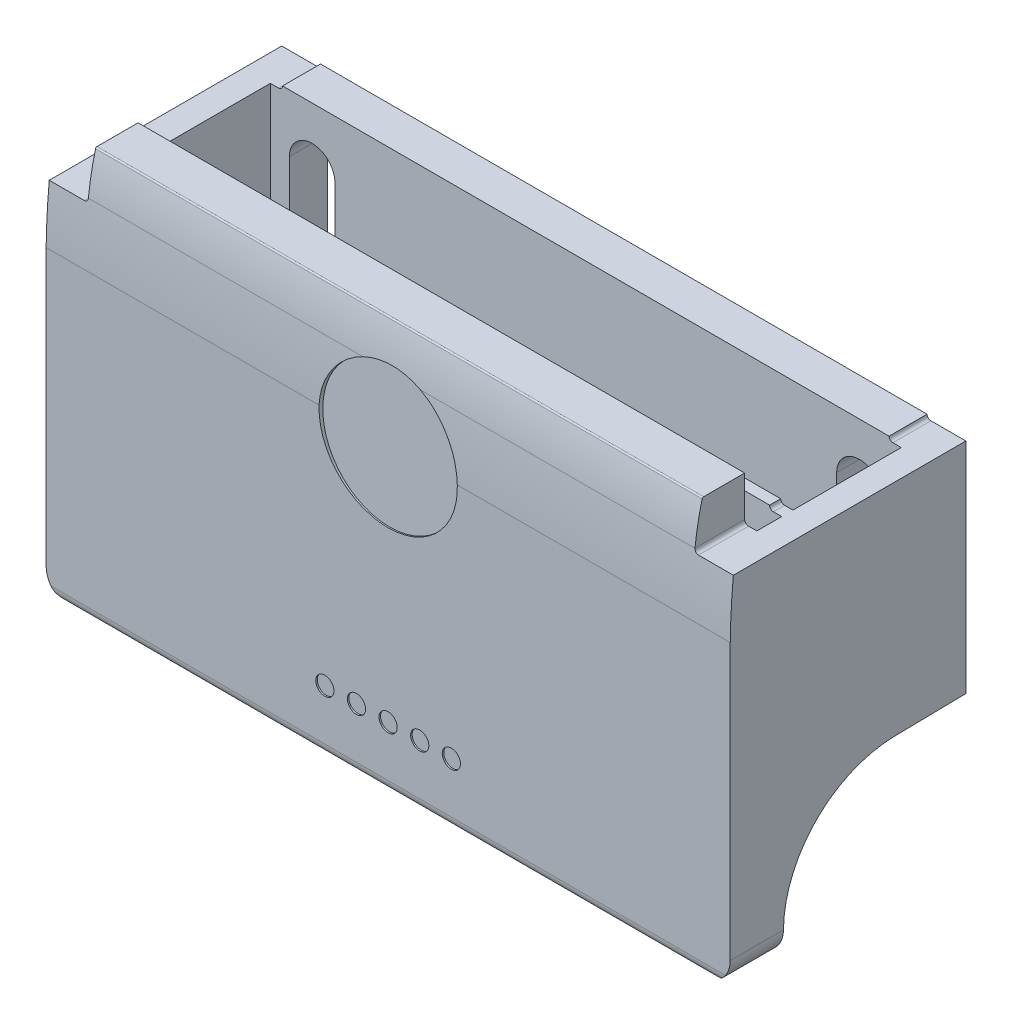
ISO-10303-21;
HEADER;
FILE_DESCRIPTION(('STEP AP214'),'2;1');
FILE_NAME('part.step','',(''),(''),'','','');
FILE_SCHEMA(('AUTOMOTIVE_DESIGN { 1 0 10303 214 1 1 1 1 }'));
ENDSEC;
DATA;
#1=APPLICATION_CONTEXT('core data for automotive mechanical design processes');
#2=APPLICATION_PROTOCOL_DEFINITION('international standard','automotive_design',2000,#1);
#3=PRODUCT_CONTEXT('',#1,'mechanical');
#4=PRODUCT('Part','Part','',(#3));
#5=PRODUCT_RELATED_PRODUCT_CATEGORY('part','',(#4));
#6=PRODUCT_DEFINITION_FORMATION('','',#4);
#7=PRODUCT_DEFINITION_CONTEXT('part definition',#1,'design');
#8=PRODUCT_DEFINITION('design','',#6,#7);
#9=PRODUCT_DEFINITION_SHAPE('','',#8);
#10=(LENGTH_UNIT() NAMED_UNIT(*) SI_UNIT(.MILLI.,.METRE.));
#11=(NAMED_UNIT(*) PLANE_ANGLE_UNIT() SI_UNIT($,.RADIAN.));
#12=(NAMED_UNIT(*) SI_UNIT($,.STERADIAN.) SOLID_ANGLE_UNIT());
#13=UNCERTAINTY_MEASURE_WITH_UNIT(LENGTH_MEASURE(1.E-05),#10,'distance_accuracy_value','');
#14=(GEOMETRIC_REPRESENTATION_CONTEXT(3) GLOBAL_UNCERTAINTY_ASSIGNED_CONTEXT((#13)) GLOBAL_UNIT_ASSIGNED_CONTEXT((#10,
#11,#12)) REPRESENTATION_CONTEXT('',''));
#15=CARTESIAN_POINT('',(0.,0.,0.));
#16=DIRECTION('',(0.,0.,1.));
#17=DIRECTION('',(1.,0.,0.));
#18=AXIS2_PLACEMENT_3D('',#15,#16,#17);
#19=CARTESIAN_POINT('',(-9.,13.3800000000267,-61.8099999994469));
#20=DIRECTION('',(1.,0.,0.));
#21=DIRECTION('',(0.,1.,0.));
#22=AXIS2_PLACEMENT_3D('',#19,#20,#21);
#23=CYLINDRICAL_SURFACE('',#22,92.8199999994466);
#24=CARTESIAN_POINT('',(45.0942016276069,14.742461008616,31.));
#25=CARTESIAN_POINT('',(45.0851256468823,14.9973975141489,30.9962679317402));
#26=CARTESIAN_POINT('',(45.0652760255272,15.2519296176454,30.9914706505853));
#27=CARTESIAN_POINT('',(45.0042878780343,15.7583701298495,30.9798668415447));
#28=CARTESIAN_POINT('',(44.9631505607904,16.0102786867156,30.9730604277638));
#29=CARTESIAN_POINT('',(44.8599028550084,16.5094035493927,30.9575678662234));
#30=CARTESIAN_POINT('',(44.7978162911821,16.7566248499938,30.9488838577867));
#31=CARTESIAN_POINT('',(44.6531107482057,17.2449123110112,30.9298216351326));
#32=CARTESIAN_POINT('',(44.5704920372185,17.4859785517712,30.919443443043));
#33=CARTESIAN_POINT('',(44.3852791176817,17.9603317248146,30.8972239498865));
#34=CARTESIAN_POINT('',(44.2826784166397,18.1936160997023,30.8853821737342));
#35=CARTESIAN_POINT('',(44.0582489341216,18.6506854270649,30.8605166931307));
#36=CARTESIAN_POINT('',(43.9364196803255,18.8744701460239,30.8474929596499));
#37=CARTESIAN_POINT('',(43.674362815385,19.3110291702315,30.8205734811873));
#38=CARTESIAN_POINT('',(43.5341297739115,19.5238001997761,30.8066774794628));
#39=CARTESIAN_POINT('',(43.236292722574,19.9367664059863,30.7783581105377));
#40=CARTESIAN_POINT('',(43.0786893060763,20.1369620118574,30.7639347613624));
#41=CARTESIAN_POINT('',(42.7467432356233,20.5239470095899,30.734876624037));
#42=CARTESIAN_POINT('',(42.5723537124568,20.7106961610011,30.7202413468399));
#43=CARTESIAN_POINT('',(42.208455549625,21.0688413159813,30.6911697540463));
#44=CARTESIAN_POINT('',(42.018947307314,21.2402377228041,30.6767334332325));
#45=CARTESIAN_POINT('',(41.6263975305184,21.566277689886,30.6484447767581));
#46=CARTESIAN_POINT('',(41.4233730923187,21.7209417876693,30.6345917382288));
#47=CARTESIAN_POINT('',(41.0050839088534,22.0126227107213,30.6078103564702));
#48=CARTESIAN_POINT('',(40.7898254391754,22.1496484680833,30.5948815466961));
#49=CARTESIAN_POINT('',(40.441119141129,22.3515571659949,30.5754377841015));
#50=CARTESIAN_POINT('',(40.3112193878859,22.42259608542,30.5685068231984));
#51=CARTESIAN_POINT('',(40.0483089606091,22.5581551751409,30.5551367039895));
#52=CARTESIAN_POINT('',(39.9153037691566,22.6226859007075,30.5486967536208));
#53=CARTESIAN_POINT('',(39.7807801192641,22.683951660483,30.542525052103));
#54=B_SPLINE_CURVE_WITH_KNOTS('',3,(#24,#25,#26,#27,#28,#29,#30,#31,#32,#33,#34,#35,#36,#37,#38,
#39,#40,#41,#42,#43,#44,#45,#46,#47,#48,#49,#50,#51,#52,#53),.UNSPECIFIED.,.F.,.F.,(4,2,2,2,2,2,
2,2,2,2,2,2,2,2,4),(0.,0.765141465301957,1.53023948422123,2.29447030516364,3.05869114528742,
3.82316070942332,4.58764905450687,5.35236348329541,6.11705179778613,6.88394084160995,
7.65080973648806,8.41672642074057,9.18225370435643,9.62674771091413,10.0705088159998),.UNSPECIFIED.);
#55=CARTESIAN_POINT('',(45.0942016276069,14.742461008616,31.));
#56=VERTEX_POINT('',#55);
#57=CARTESIAN_POINT('',(39.7807801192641,22.683951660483,30.542525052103));
#58=VERTEX_POINT('',#57);
#59=EDGE_CURVE('E9',#56,#58,#54,.T.);
#60=ORIENTED_EDGE('',*,*,#59,.F.);
#61=DIRECTION('',(1.,0.,0.));
#62=VECTOR('',#61,1.);
#63=CARTESIAN_POINT('',(-9.,14.742461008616,31.));
#64=LINE('',#63,#62);
#65=CARTESIAN_POINT('',(81.,14.742461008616,31.));
#66=VERTEX_POINT('',#65);
#67=EDGE_CURVE('E397',#56,#66,#64,.T.);
#68=ORIENTED_EDGE('',*,*,#67,.T.);
#69=CARTESIAN_POINT('',(81.,13.3800000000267,-61.8099999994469));
#70=DIRECTION('',(1.,0.,0.));
#71=DIRECTION('',(0.,1.,0.));
#72=AXIS2_PLACEMENT_3D('',#69,#70,#71);
#73=CIRCLE('',#72,92.8199999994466);
#74=CARTESIAN_POINT('',(81.,22.2,30.59));
#75=VERTEX_POINT('',#74);
#76=EDGE_CURVE('E840',#75,#66,#73,.T.);
#77=ORIENTED_EDGE('',*,*,#76,.F.);
#78=DIRECTION('',(1.,0.,0.));
#79=VECTOR('',#78,1.);
#80=CARTESIAN_POINT('',(-9.,22.2,30.59));
#81=LINE('',#80,#79);
#82=CARTESIAN_POINT('',(76.4,22.2,30.59));
#83=VERTEX_POINT('',#82);
#84=EDGE_CURVE('E715',#83,#75,#81,.T.);
#85=ORIENTED_EDGE('',*,*,#84,.F.);
#86=CARTESIAN_POINT('',(75.900257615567,22.683951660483,30.542525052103));
#87=CARTESIAN_POINT('',(75.901139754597,22.6557501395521,30.545366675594));
#88=CARTESIAN_POINT('',(75.9044544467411,22.6276305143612,30.5481860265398));
#89=CARTESIAN_POINT('',(75.915753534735,22.5723504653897,30.5537041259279));
#90=CARTESIAN_POINT('',(75.9237350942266,22.5451894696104,30.5564029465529));
#91=CARTESIAN_POINT('',(75.9441796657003,22.4925715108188,30.5616089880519));
#92=CARTESIAN_POINT('',(75.9566451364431,22.4671154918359,30.5641161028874));
#93=CARTESIAN_POINT('',(75.9857000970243,22.4186585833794,30.5688701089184));
#94=CARTESIAN_POINT('',(76.002288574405,22.3956570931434,30.5711170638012));
#95=CARTESIAN_POINT('',(76.0390787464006,22.3528243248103,30.5752871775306));
#96=CARTESIAN_POINT('',(76.0592708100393,22.3329848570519,30.5772111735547));
#97=CARTESIAN_POINT('',(76.1027348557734,22.2969740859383,30.5806938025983));
#98=CARTESIAN_POINT('',(76.1260076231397,22.2808037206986,30.5822523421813));
#99=CARTESIAN_POINT('',(76.174855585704,22.2526730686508,30.5849580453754));
#100=CARTESIAN_POINT('',(76.2004204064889,22.2406949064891,30.5861069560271));
#101=CARTESIAN_POINT('',(76.2532033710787,22.2212094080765,30.5879735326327));
#102=CARTESIAN_POINT('',(76.2804200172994,22.2136980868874,30.5886915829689));
#103=CARTESIAN_POINT('',(76.3232184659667,22.2056889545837,30.5894568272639));
#104=CARTESIAN_POINT('',(76.3385091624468,22.2035558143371,30.5896605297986));
#105=CARTESIAN_POINT('',(76.3691975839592,22.200712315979,30.5899320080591));
#106=CARTESIAN_POINT('',(76.3845950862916,22.199999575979,30.5900000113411));
#107=CARTESIAN_POINT('',(76.4,22.2,30.59));
#108=B_SPLINE_CURVE_WITH_KNOTS('',3,(#86,#87,#88,#89,#90,#91,#92,#93,#94,#95,#96,#97,#98,#99,
#100,#101,#102,#103,#104,#105,#106,#107),.UNSPECIFIED.,.F.,.F.,(4,2,2,2,2,2,2,2,2,2,4),(0.,
0.0849634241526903,0.169875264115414,0.254833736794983,0.339771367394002,0.424485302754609,
0.509220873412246,0.593590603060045,0.677884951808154,0.724146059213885,0.7703295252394),.UNSPECIFIED.);
#109=CARTESIAN_POINT('',(75.900257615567,22.683951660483,30.542525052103));
#110=VERTEX_POINT('',#109);
#111=EDGE_CURVE('E645',#110,#83,#108,.T.);
#112=ORIENTED_EDGE('',*,*,#111,.F.);
#113=DIRECTION('',(1.,0.,0.));
#114=VECTOR('',#113,1.);
#115=CARTESIAN_POINT('',(-9.,22.683951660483,30.542525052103));
#116=LINE('',#115,#114);
#117=EDGE_CURVE('E404',#58,#110,#116,.T.);
#118=ORIENTED_EDGE('',*,*,#117,.F.);
#119=EDGE_LOOP('',(#60,#68,#77,#85,#112,#118));
#120=FACE_BOUND('',#119,.T.);
#121=ADVANCED_FACE('F14',(#120),#23,.T.);
#122=CARTESIAN_POINT('',(-9.,22.7,5.));
#123=DIRECTION('',(0.,0.,1.));
#124=DIRECTION('',(1.,0.,0.));
#125=AXIS2_PLACEMENT_3D('',#122,#123,#124);
#126=PLANE('',#125);
#127=CARTESIAN_POINT('',(0.,0.,5.));
#128=DIRECTION('',(0.,0.,1.));
#129=DIRECTION('',(1.,0.,0.));
#130=AXIS2_PLACEMENT_3D('',#127,#128,#129);
#131=CIRCLE('',#130,3.);
#132=CARTESIAN_POINT('',(3.,0.,5.));
#133=VERTEX_POINT('',#132);
#134=CARTESIAN_POINT('',(-3.,0.,5.));
#135=VERTEX_POINT('',#134);
#136=EDGE_CURVE('E2421',#133,#135,#131,.F.);
#137=ORIENTED_EDGE('',*,*,#136,.T.);
#138=DIRECTION('',(0.,1.,0.));
#139=VECTOR('',#138,1.);
#140=CARTESIAN_POINT('',(-3.,22.7,5.));
#141=LINE('',#140,#139);
#142=CARTESIAN_POINT('',(-3.,15.1,5.));
#143=VERTEX_POINT('',#142);
#144=EDGE_CURVE('E2424',#135,#143,#141,.T.);
#145=ORIENTED_EDGE('',*,*,#144,.T.);
#146=CARTESIAN_POINT('',(0.,15.1,5.));
#147=DIRECTION('',(0.,0.,1.));
#148=DIRECTION('',(1.,0.,0.));
#149=AXIS2_PLACEMENT_3D('',#146,#147,#148);
#150=CIRCLE('',#149,3.);
#151=CARTESIAN_POINT('',(3.,15.1,5.));
#152=VERTEX_POINT('',#151);
#153=EDGE_CURVE('E2415',#143,#152,#150,.F.);
#154=ORIENTED_EDGE('',*,*,#153,.T.);
#155=DIRECTION('',(0.,-1.,0.));
#156=VECTOR('',#155,1.);
#157=CARTESIAN_POINT('',(3.,22.7,5.));
#158=LINE('',#157,#156);
#159=EDGE_CURVE('E2418',#152,#133,#158,.T.);
#160=ORIENTED_EDGE('',*,*,#159,.T.);
#161=EDGE_LOOP('',(#137,#145,#154,#160));
#162=FACE_BOUND('',#161,.T.);
#163=DIRECTION('',(1.,0.,0.));
#164=VECTOR('',#163,1.);
#165=CARTESIAN_POINT('',(-9.,22.2,5.));
#166=LINE('',#165,#164);
#167=CARTESIAN_POINT('',(-5.5,22.2,5.));
#168=VERTEX_POINT('',#167);
#169=CARTESIAN_POINT('',(-4.4,22.2,5.));
#170=VERTEX_POINT('',#169);
#171=EDGE_CURVE('E678',#168,#170,#166,.T.);
#172=ORIENTED_EDGE('',*,*,#171,.F.);
#173=DIRECTION('',(0.,-1.,0.));
#174=VECTOR('',#173,1.);
#175=CARTESIAN_POINT('',(-5.5,22.7,5.));
#176=LINE('',#175,#174);
#177=CARTESIAN_POINT('',(-5.5,-5.1,5.));
#178=VERTEX_POINT('',#177);
#179=EDGE_CURVE('E818',#168,#178,#176,.T.);
#180=ORIENTED_EDGE('',*,*,#179,.T.);
#181=DIRECTION('',(1.,0.,0.));
#182=VECTOR('',#181,1.);
#183=CARTESIAN_POINT('',(-9.,-5.1,5.));
#184=LINE('',#183,#182);
#185=CARTESIAN_POINT('',(77.5,-5.1,5.));
#186=VERTEX_POINT('',#185);
#187=EDGE_CURVE('E452',#178,#186,#184,.T.);
#188=ORIENTED_EDGE('',*,*,#187,.T.);
#189=DIRECTION('',(0.,-1.,0.));
#190=VECTOR('',#189,1.);
#191=CARTESIAN_POINT('',(77.5,22.7,5.));
#192=LINE('',#191,#190);
#193=CARTESIAN_POINT('',(77.5,22.2,5.));
#194=VERTEX_POINT('',#193);
#195=EDGE_CURVE('E780',#194,#186,#192,.T.);
#196=ORIENTED_EDGE('',*,*,#195,.F.);
#197=DIRECTION('',(1.,0.,0.));
#198=VECTOR('',#197,1.);
#199=CARTESIAN_POINT('',(-9.,22.2,5.));
#200=LINE('',#199,#198);
#201=CARTESIAN_POINT('',(76.4,22.2,5.));
#202=VERTEX_POINT('',#201);
#203=EDGE_CURVE('E714',#202,#194,#200,.T.);
#204=ORIENTED_EDGE('',*,*,#203,.F.);
#205=CARTESIAN_POINT('',(76.4000000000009,22.7000000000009,5.));
#206=DIRECTION('',(0.,0.,1.));
#207=DIRECTION('',(1.,0.,0.));
#208=AXIS2_PLACEMENT_3D('',#205,#206,#207);
#209=CIRCLE('',#208,0.500000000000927);
#210=CARTESIAN_POINT('',(75.9,22.7,5.));
#211=VERTEX_POINT('',#210);
#212=EDGE_CURVE('E625',#211,#202,#209,.T.);
#213=ORIENTED_EDGE('',*,*,#212,.F.);
#214=DIRECTION('',(1.,0.,0.));
#215=VECTOR('',#214,1.);
#216=CARTESIAN_POINT('',(-9.,22.7,5.));
#217=LINE('',#216,#215);
#218=CARTESIAN_POINT('',(-3.9,22.7,5.));
#219=VERTEX_POINT('',#218);
#220=EDGE_CURVE('E455',#219,#211,#217,.T.);
#221=ORIENTED_EDGE('',*,*,#220,.F.);
#222=CARTESIAN_POINT('',(-4.40000000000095,22.7000000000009,5.));
#223=DIRECTION('',(0.,0.,1.));
#224=DIRECTION('',(1.,0.,0.));
#225=AXIS2_PLACEMENT_3D('',#222,#223,#224);
#226=CIRCLE('',#225,0.500000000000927);
#227=EDGE_CURVE('E1122',#170,#219,#226,.T.);
#228=ORIENTED_EDGE('',*,*,#227,.F.);
#229=EDGE_LOOP('',(#172,#180,#188,#196,#204,#213,#221,#228));
#230=FACE_BOUND('',#229,.T.);
#231=CARTESIAN_POINT('',(72.,0.,5.));
#232=DIRECTION('',(0.,0.,1.));
#233=DIRECTION('',(1.,0.,0.));
#234=AXIS2_PLACEMENT_3D('',#231,#232,#233);
#235=CIRCLE('',#234,3.);
#236=CARTESIAN_POINT('',(75.,0.,5.));
#237=VERTEX_POINT('',#236);
#238=CARTESIAN_POINT('',(69.,0.,5.));
#239=VERTEX_POINT('',#238);
#240=EDGE_CURVE('E2378',#237,#239,#235,.F.);
#241=ORIENTED_EDGE('',*,*,#240,.T.);
#242=DIRECTION('',(0.,1.,0.));
#243=VECTOR('',#242,1.);
#244=CARTESIAN_POINT('',(69.,22.7,5.));
#245=LINE('',#244,#243);
#246=CARTESIAN_POINT('',(69.,15.1,5.));
#247=VERTEX_POINT('',#246);
#248=EDGE_CURVE('E2380',#239,#247,#245,.T.);
#249=ORIENTED_EDGE('',*,*,#248,.T.);
#250=CARTESIAN_POINT('',(72.,15.1,5.));
#251=DIRECTION('',(0.,0.,1.));
#252=DIRECTION('',(1.,0.,0.));
#253=AXIS2_PLACEMENT_3D('',#250,#251,#252);
#254=CIRCLE('',#253,3.);
#255=CARTESIAN_POINT('',(75.,15.1,5.));
#256=VERTEX_POINT('',#255);
#257=EDGE_CURVE('E2387',#247,#256,#254,.F.);
#258=ORIENTED_EDGE('',*,*,#257,.T.);
#259=DIRECTION('',(0.,-1.,0.));
#260=VECTOR('',#259,1.);
#261=CARTESIAN_POINT('',(75.,22.7,5.));
#262=LINE('',#261,#260);
#263=EDGE_CURVE('E2381',#256,#237,#262,.T.);
#264=ORIENTED_EDGE('',*,*,#263,.T.);
#265=EDGE_LOOP('',(#241,#249,#258,#264));
#266=FACE_BOUND('',#265,.T.);
#267=ADVANCED_FACE('F979',(#162,#230,#266),#126,.T.);
#268=CARTESIAN_POINT('',(-9.,-6.58,0.));
#269=DIRECTION('',(0.,0.,-1.));
#270=DIRECTION('',(-1.,0.,0.));
#271=AXIS2_PLACEMENT_3D('',#268,#269,#270);
#272=PLANE('',#271);
#273=CARTESIAN_POINT('',(0.,15.1,0.));
#274=DIRECTION('',(0.,0.,1.));
#275=DIRECTION('',(0.,-1.,0.));
#276=AXIS2_PLACEMENT_3D('',#273,#274,#275);
#277=CIRCLE('',#276,3.);
#278=CARTESIAN_POINT('',(3.,15.1,0.));
#279=VERTEX_POINT('',#278);
#280=CARTESIAN_POINT('',(-3.,15.1,0.));
#281=VERTEX_POINT('',#280);
#282=EDGE_CURVE('E2399',#279,#281,#277,.T.);
#283=ORIENTED_EDGE('',*,*,#282,.T.);
#284=DIRECTION('',(0.,-1.,0.));
#285=VECTOR('',#284,1.);
#286=CARTESIAN_POINT('',(-3.,15.1,0.));
#287=LINE('',#286,#285);
#288=CARTESIAN_POINT('',(-3.,0.,0.));
#289=VERTEX_POINT('',#288);
#290=EDGE_CURVE('E2385',#281,#289,#287,.T.);
#291=ORIENTED_EDGE('',*,*,#290,.T.);
#292=CARTESIAN_POINT('',(0.,0.,0.));
#293=DIRECTION('',(0.,0.,1.));
#294=DIRECTION('',(0.,1.,0.));
#295=AXIS2_PLACEMENT_3D('',#292,#293,#294);
#296=CIRCLE('',#295,3.);
#297=CARTESIAN_POINT('',(3.,0.,0.));
#298=VERTEX_POINT('',#297);
#299=EDGE_CURVE('E2391',#289,#298,#296,.T.);
#300=ORIENTED_EDGE('',*,*,#299,.T.);
#301=DIRECTION('',(0.,1.,0.));
#302=VECTOR('',#301,1.);
#303=CARTESIAN_POINT('',(3.,0.,0.));
#304=LINE('',#303,#302);
#305=EDGE_CURVE('E2395',#298,#279,#304,.T.);
#306=ORIENTED_EDGE('',*,*,#305,.T.);
#307=EDGE_LOOP('',(#283,#291,#300,#306));
#308=FACE_BOUND('',#307,.T.);
#309=DIRECTION('',(-1.,0.,0.));
#310=VECTOR('',#309,1.);
#311=CARTESIAN_POINT('',(-4.4,22.2,0.));
#312=LINE('',#311,#310);
#313=CARTESIAN_POINT('',(-4.4,22.2,0.));
#314=VERTEX_POINT('',#313);
#315=CARTESIAN_POINT('',(-9.,22.2,0.));
#316=VERTEX_POINT('',#315);
#317=EDGE_CURVE('E858',#314,#316,#312,.T.);
#318=ORIENTED_EDGE('',*,*,#317,.F.);
#319=CARTESIAN_POINT('',(-4.40000000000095,22.7000000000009,0.));
#320=DIRECTION('',(0.,0.,-1.));
#321=DIRECTION('',(0.,1.,0.));
#322=AXIS2_PLACEMENT_3D('',#319,#320,#321);
#323=CIRCLE('',#322,0.500000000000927);
#324=CARTESIAN_POINT('',(-3.9,22.7,0.));
#325=VERTEX_POINT('',#324);
#326=EDGE_CURVE('E1098',#325,#314,#323,.T.);
#327=ORIENTED_EDGE('',*,*,#326,.F.);
#328=DIRECTION('',(1.,0.,0.));
#329=VECTOR('',#328,1.);
#330=CARTESIAN_POINT('',(-9.,22.7,0.));
#331=LINE('',#330,#329);
#332=CARTESIAN_POINT('',(75.9,22.7,0.));
#333=VERTEX_POINT('',#332);
#334=EDGE_CURVE('E458',#325,#333,#331,.T.);
#335=ORIENTED_EDGE('',*,*,#334,.T.);
#336=CARTESIAN_POINT('',(76.4000000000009,22.7000000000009,0.));
#337=DIRECTION('',(0.,0.,-1.));
#338=DIRECTION('',(0.,1.,0.));
#339=AXIS2_PLACEMENT_3D('',#336,#337,#338);
#340=CIRCLE('',#339,0.500000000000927);
#341=CARTESIAN_POINT('',(76.4,22.2,0.));
#342=VERTEX_POINT('',#341);
#343=EDGE_CURVE('E1089',#342,#333,#340,.T.);
#344=ORIENTED_EDGE('',*,*,#343,.F.);
#345=DIRECTION('',(-1.,0.,0.));
#346=VECTOR('',#345,1.);
#347=CARTESIAN_POINT('',(81.,22.2,0.));
#348=LINE('',#347,#346);
#349=CARTESIAN_POINT('',(81.,22.2,0.));
#350=VERTEX_POINT('',#349);
#351=EDGE_CURVE('E1088',#350,#342,#348,.T.);
#352=ORIENTED_EDGE('',*,*,#351,.F.);
#353=DIRECTION('',(0.,1.,0.));
#354=VECTOR('',#353,1.);
#355=CARTESIAN_POINT('',(81.,-6.58,0.));
#356=LINE('',#355,#354);
#357=CARTESIAN_POINT('',(81.,-6.58,0.));
#358=VERTEX_POINT('',#357);
#359=EDGE_CURVE('E836',#358,#350,#356,.T.);
#360=ORIENTED_EDGE('',*,*,#359,.F.);
#361=DIRECTION('',(1.,0.,0.));
#362=VECTOR('',#361,1.);
#363=CARTESIAN_POINT('',(-9.,-6.58,0.));
#364=LINE('',#363,#362);
#365=CARTESIAN_POINT('',(-9.,-6.58,0.));
#366=VERTEX_POINT('',#365);
#367=EDGE_CURVE('E461',#366,#358,#364,.T.);
#368=ORIENTED_EDGE('',*,*,#367,.F.);
#369=DIRECTION('',(0.,1.,0.));
#370=VECTOR('',#369,1.);
#371=CARTESIAN_POINT('',(-9.,-6.58,0.));
#372=LINE('',#371,#370);
#373=EDGE_CURVE('E846',#366,#316,#372,.T.);
#374=ORIENTED_EDGE('',*,*,#373,.T.);
#375=EDGE_LOOP('',(#318,#327,#335,#344,#352,#360,#368,#374));
#376=FACE_BOUND('',#375,.T.);
#377=CARTESIAN_POINT('',(72.,15.1,0.));
#378=DIRECTION('',(0.,0.,1.));
#379=DIRECTION('',(0.,-1.,0.));
#380=AXIS2_PLACEMENT_3D('',#377,#378,#379);
#381=CIRCLE('',#380,3.);
#382=CARTESIAN_POINT('',(75.,15.1,0.));
#383=VERTEX_POINT('',#382);
#384=CARTESIAN_POINT('',(69.,15.1,0.));
#385=VERTEX_POINT('',#384);
#386=EDGE_CURVE('E2489',#383,#385,#381,.T.);
#387=ORIENTED_EDGE('',*,*,#386,.T.);
#388=DIRECTION('',(0.,-1.,0.));
#389=VECTOR('',#388,1.);
#390=CARTESIAN_POINT('',(69.,15.1,0.));
#391=LINE('',#390,#389);
#392=CARTESIAN_POINT('',(69.,0.,0.));
#393=VERTEX_POINT('',#392);
#394=EDGE_CURVE('E398',#385,#393,#391,.T.);
#395=ORIENTED_EDGE('',*,*,#394,.T.);
#396=CARTESIAN_POINT('',(72.,0.,0.));
#397=DIRECTION('',(0.,0.,1.));
#398=DIRECTION('',(0.,1.,0.));
#399=AXIS2_PLACEMENT_3D('',#396,#397,#398);
#400=CIRCLE('',#399,3.);
#401=CARTESIAN_POINT('',(75.,0.,0.));
#402=VERTEX_POINT('',#401);
#403=EDGE_CURVE('E2480',#393,#402,#400,.T.);
#404=ORIENTED_EDGE('',*,*,#403,.T.);
#405=DIRECTION('',(0.,1.,0.));
#406=VECTOR('',#405,1.);
#407=CARTESIAN_POINT('',(75.,0.,0.));
#408=LINE('',#407,#406);
#409=EDGE_CURVE('E2485',#402,#383,#408,.T.);
#410=ORIENTED_EDGE('',*,*,#409,.T.);
#411=EDGE_LOOP('',(#387,#395,#404,#410));
#412=FACE_BOUND('',#411,.T.);
#413=ADVANCED_FACE('F855',(#308,#376,#412),#272,.T.);
#414=CARTESIAN_POINT('',(-9.,14.742461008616,31.));
#415=DIRECTION('',(0.,0.,1.));
#416=DIRECTION('',(1.,0.,0.));
#417=AXIS2_PLACEMENT_3D('',#414,#415,#416);
#418=PLANE('',#417);
#419=CARTESIAN_POINT('',(36.,14.4174603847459,31.));
#420=DIRECTION('',(0.,0.,1.));
#421=DIRECTION('',(0.,1.,0.));
#422=AXIS2_PLACEMENT_3D('',#419,#420,#421);
#423=ELLIPSE('',#422,9.10554685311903,9.09999999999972);
#424=CARTESIAN_POINT('',(26.905798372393,14.742461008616,31.));
#425=VERTEX_POINT('',#424);
#426=EDGE_CURVE('E383',#425,#56,#423,.T.);
#427=ORIENTED_EDGE('',*,*,#426,.F.);
#428=CARTESIAN_POINT('',(-9.,14.742461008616,31.));
#429=VERTEX_POINT('',#428);
#430=EDGE_CURVE('E394',#429,#425,#64,.T.);
#431=ORIENTED_EDGE('',*,*,#430,.F.);
#432=DIRECTION('',(0.,-1.,0.));
#433=VECTOR('',#432,1.);
#434=CARTESIAN_POINT('',(-9.,14.742461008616,31.));
#435=LINE('',#434,#433);
#436=CARTESIAN_POINT('',(-9.,-21.5,31.));
#437=VERTEX_POINT('',#436);
#438=EDGE_CURVE('E409',#429,#437,#435,.T.);
#439=ORIENTED_EDGE('',*,*,#438,.T.);
#440=CARTESIAN_POINT('',(-5.5,-21.5,31.));
#441=DIRECTION('',(0.,0.,1.));
#442=DIRECTION('',(1.,0.,0.));
#443=AXIS2_PLACEMENT_3D('',#440,#441,#442);
#444=CIRCLE('',#443,3.49999999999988);
#445=CARTESIAN_POINT('',(-8.37228132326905,-23.5,31.));
#446=VERTEX_POINT('',#445);
#447=EDGE_CURVE('E551',#446,#437,#444,.F.);
#448=ORIENTED_EDGE('',*,*,#447,.F.);
#449=DIRECTION('',(1.,0.,0.));
#450=VECTOR('',#449,1.);
#451=CARTESIAN_POINT('',(-14.,-23.5,31.));
#452=LINE('',#451,#450);
#453=CARTESIAN_POINT('',(80.372281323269,-23.5,31.));
#454=VERTEX_POINT('',#453);
#455=EDGE_CURVE('E890',#446,#454,#452,.T.);
#456=ORIENTED_EDGE('',*,*,#455,.T.);
#457=CARTESIAN_POINT('',(77.5,-21.5,31.));
#458=DIRECTION('',(0.,0.,1.));
#459=DIRECTION('',(1.,0.,0.));
#460=AXIS2_PLACEMENT_3D('',#457,#458,#459);
#461=CIRCLE('',#460,3.49999999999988);
#462=CARTESIAN_POINT('',(81.,-21.5,31.));
#463=VERTEX_POINT('',#462);
#464=EDGE_CURVE('E529',#463,#454,#461,.F.);
#465=ORIENTED_EDGE('',*,*,#464,.F.);
#466=DIRECTION('',(0.,-1.,0.));
#467=VECTOR('',#466,1.);
#468=CARTESIAN_POINT('',(81.,14.742461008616,31.));
#469=LINE('',#468,#467);
#470=EDGE_CURVE('E832',#66,#463,#469,.T.);
#471=ORIENTED_EDGE('',*,*,#470,.F.);
#472=ORIENTED_EDGE('',*,*,#67,.F.);
#473=EDGE_LOOP('',(#427,#431,#439,#448,#456,#465,#471,#472));
#474=FACE_BOUND('',#473,.T.);
#475=CARTESIAN_POINT('',(35.99,-16.85,31.));
#476=DIRECTION('',(0.,0.,-1.));
#477=DIRECTION('',(0.,1.,0.));
#478=AXIS2_PLACEMENT_3D('',#475,#476,#477);
#479=CIRCLE('',#478,1.2);
#480=CARTESIAN_POINT('',(35.99,-15.65,31.));
#481=VERTEX_POINT('',#480);
#482=EDGE_CURVE('E2434',#481,#481,#479,.T.);
#483=ORIENTED_EDGE('',*,*,#482,.T.);
#484=EDGE_LOOP('',(#483));
#485=FACE_BOUND('',#484,.T.);
#486=CARTESIAN_POINT('',(44.31,-16.85,31.));
#487=DIRECTION('',(0.,0.,-1.));
#488=DIRECTION('',(0.,1.,0.));
#489=AXIS2_PLACEMENT_3D('',#486,#487,#488);
#490=CIRCLE('',#489,1.2);
#491=CARTESIAN_POINT('',(44.31,-15.65,31.));
#492=VERTEX_POINT('',#491);
#493=EDGE_CURVE('E2448',#492,#492,#490,.T.);
#494=ORIENTED_EDGE('',*,*,#493,.T.);
#495=EDGE_LOOP('',(#494));
#496=FACE_BOUND('',#495,.T.);
#497=CARTESIAN_POINT('',(27.67,-16.85,31.));
#498=DIRECTION('',(0.,0.,-1.));
#499=DIRECTION('',(0.,1.,0.));
#500=AXIS2_PLACEMENT_3D('',#497,#498,#499);
#501=CIRCLE('',#500,1.2);
#502=CARTESIAN_POINT('',(27.67,-15.65,31.));
#503=VERTEX_POINT('',#502);
#504=EDGE_CURVE('E897',#503,#503,#501,.T.);
#505=ORIENTED_EDGE('',*,*,#504,.T.);
#506=EDGE_LOOP('',(#505));
#507=FACE_BOUND('',#506,.T.);
#508=CARTESIAN_POINT('',(40.15,-16.85,31.));
#509=DIRECTION('',(0.,0.,-1.));
#510=DIRECTION('',(0.,1.,0.));
#511=AXIS2_PLACEMENT_3D('',#508,#509,#510);
#512=CIRCLE('',#511,1.2);
#513=CARTESIAN_POINT('',(40.15,-15.65,31.));
#514=VERTEX_POINT('',#513);
#515=EDGE_CURVE('E2441',#514,#514,#512,.T.);
#516=ORIENTED_EDGE('',*,*,#515,.T.);
#517=EDGE_LOOP('',(#516));
#518=FACE_BOUND('',#517,.T.);
#519=CARTESIAN_POINT('',(31.83,-16.85,31.));
#520=DIRECTION('',(0.,0.,-1.));
#521=DIRECTION('',(0.,1.,0.));
#522=AXIS2_PLACEMENT_3D('',#519,#520,#521);
#523=CIRCLE('',#522,1.2);
#524=CARTESIAN_POINT('',(31.83,-15.65,31.));
#525=VERTEX_POINT('',#524);
#526=EDGE_CURVE('E2427',#525,#525,#523,.T.);
#527=ORIENTED_EDGE('',*,*,#526,.T.);
#528=EDGE_LOOP('',(#527));
#529=FACE_BOUND('',#528,.T.);
#530=ADVANCED_FACE('F16',(#474,#485,#496,#507,#518,#529),#418,.T.);
#531=CARTESIAN_POINT('',(-9.,-25.,31.));
#532=DIRECTION('',(0.,-1.,0.));
#533=DIRECTION('',(1.,0.,0.));
#534=AXIS2_PLACEMENT_3D('',#531,#532,#533);
#535=PLANE('',#534);
#536=DIRECTION('',(1.,0.,0.));
#537=VECTOR('',#536,1.);
#538=CARTESIAN_POINT('',(-9.,-25.,25.5));
#539=LINE('',#538,#537);
#540=CARTESIAN_POINT('',(-5.5,-25.,25.5));
#541=VERTEX_POINT('',#540);
#542=CARTESIAN_POINT('',(77.5,-25.,25.5));
#543=VERTEX_POINT('',#542);
#544=EDGE_CURVE('E478',#541,#543,#539,.T.);
#545=ORIENTED_EDGE('',*,*,#544,.T.);
#546=DIRECTION('',(0.,0.,-1.));
#547=VECTOR('',#546,1.);
#548=CARTESIAN_POINT('',(77.5,-25.,35.));
#549=LINE('',#548,#547);
#550=CARTESIAN_POINT('',(77.5,-25.,29.5));
#551=VERTEX_POINT('',#550);
#552=EDGE_CURVE('E1092',#551,#543,#549,.T.);
#553=ORIENTED_EDGE('',*,*,#552,.F.);
#554=DIRECTION('',(1.,0.,0.));
#555=VECTOR('',#554,1.);
#556=CARTESIAN_POINT('',(-14.,-25.,29.5));
#557=LINE('',#556,#555);
#558=CARTESIAN_POINT('',(-5.5,-25.,29.5));
#559=VERTEX_POINT('',#558);
#560=EDGE_CURVE('E892',#559,#551,#557,.T.);
#561=ORIENTED_EDGE('',*,*,#560,.F.);
#562=DIRECTION('',(0.,0.,-1.));
#563=VECTOR('',#562,1.);
#564=CARTESIAN_POINT('',(-5.5,-25.,35.));
#565=LINE('',#564,#563);
#566=EDGE_CURVE('E700',#559,#541,#565,.T.);
#567=ORIENTED_EDGE('',*,*,#566,.T.);
#568=EDGE_LOOP('',(#545,#553,#561,#567));
#569=FACE_BOUND('',#568,.T.);
#570=ADVANCED_FACE('F510',(#569),#535,.T.);
#571=CARTESIAN_POINT('',(77.5,-21.5,35.));
#572=DIRECTION('',(0.,0.,-1.));
#573=DIRECTION('',(-1.,0.,0.));
#574=AXIS2_PLACEMENT_3D('',#571,#572,#573);
#575=CYLINDRICAL_SURFACE('',#574,3.49999999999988);
#576=CARTESIAN_POINT('',(80.372281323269,-23.5,31.));
#577=CARTESIAN_POINT('',(80.3355316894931,-23.5528007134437,30.9999960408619));
#578=CARTESIAN_POINT('',(80.2973382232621,-23.6045259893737,30.9972138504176));
#579=CARTESIAN_POINT('',(80.2185029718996,-23.7054039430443,30.9867337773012));
#580=CARTESIAN_POINT('',(80.1778660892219,-23.7545614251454,30.9790454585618));
#581=CARTESIAN_POINT('',(80.0948766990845,-23.8495871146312,30.9594924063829));
#582=CARTESIAN_POINT('',(80.0525467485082,-23.8954844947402,30.9476724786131));
#583=CARTESIAN_POINT('',(79.9660700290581,-23.9844218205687,30.9203869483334));
#584=CARTESIAN_POINT('',(79.9219221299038,-24.0274599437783,30.9049190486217));
#585=CARTESIAN_POINT('',(79.7561037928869,-24.1808732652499,30.8420288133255));
#586=CARTESIAN_POINT('',(79.6295395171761,-24.282095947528,30.7847894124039));
#587=CARTESIAN_POINT('',(79.3687234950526,-24.4636759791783,30.6549403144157));
#588=CARTESIAN_POINT('',(79.2344294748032,-24.5439019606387,30.5822387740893));
#589=CARTESIAN_POINT('',(79.0014557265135,-24.6634403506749,30.4496568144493));
#590=CARTESIAN_POINT('',(78.9039038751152,-24.7078482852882,30.3922845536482));
#591=CARTESIAN_POINT('',(78.7071188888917,-24.7869619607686,30.2738252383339));
#592=CARTESIAN_POINT('',(78.607885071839,-24.8216636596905,30.2127366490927));
#593=CARTESIAN_POINT('',(78.3088677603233,-24.9116001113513,30.0258246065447));
#594=CARTESIAN_POINT('',(78.107223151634,-24.9529388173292,29.8960351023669));
#595=CARTESIAN_POINT('',(77.773422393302,-24.9918118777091,29.6789793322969));
#596=CARTESIAN_POINT('',(77.6416460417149,-24.9996136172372,29.5927286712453));
#597=CARTESIAN_POINT('',(77.5065996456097,-24.9999953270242,29.5043204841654));
#598=CARTESIAN_POINT('',(77.5032998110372,-24.9999999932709,29.5021602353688));
#599=CARTESIAN_POINT('',(77.5,-25.,29.5));
#600=B_SPLINE_CURVE_WITH_KNOTS('',3,(#576,#577,#578,#579,#580,#581,#582,#583,#584,#585,#586,
#587,#588,#589,#590,#591,#592,#593,#594,#595,#596,#597,#598,#599),.UNSPECIFIED.,.F.,.F.,(4,2,2,
2,2,2,2,2,2,2,2,4),(0.,0.192823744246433,0.385272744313,0.575696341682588,0.766240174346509,
1.2788786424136,1.79465169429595,2.15889889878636,2.52329756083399,3.25005415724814,
3.7224531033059,3.73428527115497),.UNSPECIFIED.);
#601=EDGE_CURVE('E887',#551,#454,#600,.F.);
#602=ORIENTED_EDGE('',*,*,#601,.F.);
#603=ORIENTED_EDGE('',*,*,#552,.T.);
#604=CARTESIAN_POINT('',(80.9641016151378,-22.,25.5));
#605=CARTESIAN_POINT('',(80.9640973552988,-22.0000001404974,25.4584756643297));
#606=CARTESIAN_POINT('',(80.9638530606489,-22.0017254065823,25.4169710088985));
#607=CARTESIAN_POINT('',(80.9628509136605,-22.0086072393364,25.3342537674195));
#608=CARTESIAN_POINT('',(80.9620930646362,-22.0137637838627,25.2930411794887));
#609=CARTESIAN_POINT('',(80.9590008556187,-22.034339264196,25.170295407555));
#610=CARTESIAN_POINT('',(80.9558479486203,-22.0548641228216,25.0895765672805));
#611=CARTESIAN_POINT('',(80.9467329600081,-22.1089128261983,24.9327533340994));
#612=CARTESIAN_POINT('',(80.940768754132,-22.1424464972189,24.8566524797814));
#613=CARTESIAN_POINT('',(80.9250843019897,-22.2213943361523,24.7113332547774));
#614=CARTESIAN_POINT('',(80.9153659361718,-22.2668025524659,24.6421114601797));
#615=CARTESIAN_POINT('',(80.8912251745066,-22.367308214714,24.513283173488));
#616=CARTESIAN_POINT('',(80.8768560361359,-22.4222928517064,24.4535787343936));
#617=CARTESIAN_POINT('',(80.8424267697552,-22.540164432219,24.344508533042));
#618=CARTESIAN_POINT('',(80.8223670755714,-22.6030507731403,24.2951419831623));
#619=CARTESIAN_POINT('',(80.776327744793,-22.7330203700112,24.2085922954));
#620=CARTESIAN_POINT('',(80.7504575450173,-22.8000112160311,24.1712115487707));
#621=CARTESIAN_POINT('',(80.6924552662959,-22.9365695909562,24.107801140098));
#622=CARTESIAN_POINT('',(80.6603229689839,-23.0061372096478,24.0817718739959));
#623=CARTESIAN_POINT('',(80.5888426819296,-23.1478976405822,24.0399735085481));
#624=CARTESIAN_POINT('',(80.5492811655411,-23.2200969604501,24.0245962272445));
#625=CARTESIAN_POINT('',(80.4644211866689,-23.3625534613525,24.0045757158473));
#626=CARTESIAN_POINT('',(80.4191194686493,-23.4328095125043,23.9999386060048));
#627=CARTESIAN_POINT('',(80.3029910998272,-23.5994006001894,24.0000893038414));
#628=CARTESIAN_POINT('',(80.2295753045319,-23.6939329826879,24.0097974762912));
#629=CARTESIAN_POINT('',(80.0750475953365,-23.8734487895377,24.0443447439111));
#630=CARTESIAN_POINT('',(79.9939202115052,-23.9584122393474,24.0692148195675));
#631=CARTESIAN_POINT('',(79.7920951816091,-24.1500339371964,24.1428575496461));
#632=CARTESIAN_POINT('',(79.6686399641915,-24.2516120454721,24.1972258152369));
#633=CARTESIAN_POINT('',(79.4144103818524,-24.4342212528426,24.3212492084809));
#634=CARTESIAN_POINT('',(79.2836211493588,-24.5152086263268,24.3909362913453));
#635=CARTESIAN_POINT('',(79.0561302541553,-24.6368634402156,24.5187299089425));
#636=CARTESIAN_POINT('',(78.960557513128,-24.6824102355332,24.5743238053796));
#637=CARTESIAN_POINT('',(78.7676500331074,-24.7640526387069,24.6893526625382));
#638=CARTESIAN_POINT('',(78.6703145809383,-24.8001443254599,24.7487892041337));
#639=CARTESIAN_POINT('',(78.4745004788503,-24.8631707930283,24.8703586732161));
#640=CARTESIAN_POINT('',(78.3760227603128,-24.8901125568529,24.9324895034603));
#641=CARTESIAN_POINT('',(78.1782863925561,-24.935143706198,25.0585867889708));
#642=CARTESIAN_POINT('',(78.0790278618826,-24.953234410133,25.1225529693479));
#643=CARTESIAN_POINT('',(77.8233654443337,-24.9885913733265,25.2883233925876));
#644=CARTESIAN_POINT('',(77.6665515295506,-24.999543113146,25.3909667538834));
#645=CARTESIAN_POINT('',(77.5065995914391,-24.9999953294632,25.4956795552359));
#646=CARTESIAN_POINT('',(77.5032997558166,-24.9999999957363,25.4978398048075));
#647=CARTESIAN_POINT('',(77.5,-25.,25.5));
#648=B_SPLINE_CURVE_WITH_KNOTS('',3,(#604,#605,#606,#607,#608,#609,#610,#611,#612,#613,#614,
#615,#616,#617,#618,#619,#620,#621,#622,#623,#624,#625,#626,#627,#628,#629,#630,#631,#632,#633,
#634,#635,#636,#637,#638,#639,#640,#641,#642,#643,#644,#645,#646,#647),.UNSPECIFIED.,.F.,.F.,(4,
2,2,2,2,2,2,2,2,2,2,2,2,2,2,2,2,2,2,2,2,4),(0.,0.124497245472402,0.248993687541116,
0.497756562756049,0.746707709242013,0.995534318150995,1.24160677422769,1.48766047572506,
1.72941958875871,1.9711871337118,2.22143307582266,2.47182158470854,2.83006842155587,
3.18904973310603,3.69288689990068,4.19778522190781,4.55608261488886,4.91452836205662,
5.272699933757,5.63081813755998,6.1925105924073,6.20434276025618),.UNSPECIFIED.);
#649=CARTESIAN_POINT('',(80.372281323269,-23.5,24.));
#650=VERTEX_POINT('',#649);
#651=EDGE_CURVE('E521',#543,#650,#648,.F.);
#652=ORIENTED_EDGE('',*,*,#651,.T.);
#653=CARTESIAN_POINT('',(77.5,-21.5,24.));
#654=DIRECTION('',(0.,0.,-1.));
#655=DIRECTION('',(-1.,0.,0.));
#656=AXIS2_PLACEMENT_3D('',#653,#654,#655);
#657=CIRCLE('',#656,3.49999999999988);
#658=CARTESIAN_POINT('',(80.99715423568,-21.641110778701,24.));
#659=VERTEX_POINT('',#658);
#660=EDGE_CURVE('E530',#650,#659,#657,.F.);
#661=ORIENTED_EDGE('',*,*,#660,.T.);
#662=CARTESIAN_POINT('',(80.99715423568,-21.641110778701,24.));
#663=CARTESIAN_POINT('',(80.9981027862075,-21.6176013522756,24.000000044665));
#664=CARTESIAN_POINT('',(80.998814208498,-21.5940874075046,23.9999443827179));
#665=CARTESIAN_POINT('',(80.9997627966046,-21.5470504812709,23.9997216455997));
#666=CARTESIAN_POINT('',(80.9999999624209,-21.5235274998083,23.9995545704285));
#667=CARTESIAN_POINT('',(81.,-21.5,23.9993317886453));
#668=B_SPLINE_CURVE_WITH_KNOTS('',3,(#662,#663,#664,#665,#666,#667),.UNSPECIFIED.,.F.,.F.,(4,2,
4),(0.,0.0705743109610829,0.14114862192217),.UNSPECIFIED.);
#669=CARTESIAN_POINT('',(81.,-21.5,23.9993317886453));
#670=VERTEX_POINT('',#669);
#671=EDGE_CURVE('E484',#659,#670,#668,.T.);
#672=ORIENTED_EDGE('',*,*,#671,.T.);
#673=DIRECTION('',(0.,0.,-1.));
#674=VECTOR('',#673,1.);
#675=CARTESIAN_POINT('',(81.,-21.5,35.));
#676=LINE('',#675,#674);
#677=EDGE_CURVE('E889',#463,#670,#676,.T.);
#678=ORIENTED_EDGE('',*,*,#677,.F.);
#679=ORIENTED_EDGE('',*,*,#464,.T.);
#680=EDGE_LOOP('',(#602,#603,#652,#661,#672,#678,#679));
#681=FACE_BOUND('',#680,.T.);
#682=ADVANCED_FACE('F504',(#681),#575,.T.);
#683=CARTESIAN_POINT('',(-5.5,-21.641110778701,9.10000000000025));
#684=DIRECTION('',(-1.,0.,0.));
#685=DIRECTION('',(0.,-1.,0.));
#686=AXIS2_PLACEMENT_3D('',#683,#684,#685);
#687=PLANE('',#686);
#688=ORIENTED_EDGE('',*,*,#179,.F.);
#689=DIRECTION('',(0.,0.,1.));
#690=VECTOR('',#689,1.);
#691=CARTESIAN_POINT('',(-5.5,22.2,9.10000000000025));
#692=LINE('',#691,#690);
#693=CARTESIAN_POINT('',(-5.5,22.2,19.2556365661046));
#694=VERTEX_POINT('',#693);
#695=EDGE_CURVE('E864',#168,#694,#692,.T.);
#696=ORIENTED_EDGE('',*,*,#695,.T.);
#697=DIRECTION('',(0.,0.999961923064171,0.00872653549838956));
#698=VECTOR('',#697,1.);
#699=CARTESIAN_POINT('',(-5.5,-5.10261796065,19.01737022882));
#700=LINE('',#699,#698);
#701=CARTESIAN_POINT('',(-5.5,-5.10261796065,19.01737022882));
#702=VERTEX_POINT('',#701);
#703=EDGE_CURVE('E809',#702,#694,#700,.T.);
#704=ORIENTED_EDGE('',*,*,#703,.F.);
#705=CARTESIAN_POINT('',(-5.5,-5.1000000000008,18.7173816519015));
#706=DIRECTION('',(-1.,0.,0.));
#707=DIRECTION('',(0.,-1.,0.));
#708=AXIS2_PLACEMENT_3D('',#705,#706,#707);
#709=CIRCLE('',#708,0.299999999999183);
#710=CARTESIAN_POINT('',(-5.5,-5.4,18.717381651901));
#711=VERTEX_POINT('',#710);
#712=EDGE_CURVE('E812',#711,#702,#709,.T.);
#713=ORIENTED_EDGE('',*,*,#712,.F.);
#714=DIRECTION('',(0.,0.,1.));
#715=VECTOR('',#714,1.);
#716=CARTESIAN_POINT('',(-5.5,-5.4,5.3));
#717=LINE('',#716,#715);
#718=CARTESIAN_POINT('',(-5.5,-5.4,5.3));
#719=VERTEX_POINT('',#718);
#720=EDGE_CURVE('E814',#719,#711,#717,.T.);
#721=ORIENTED_EDGE('',*,*,#720,.F.);
#722=CARTESIAN_POINT('',(-5.5,-5.1,5.29999999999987));
#723=DIRECTION('',(-1.,0.,0.));
#724=DIRECTION('',(0.,-1.,0.));
#725=AXIS2_PLACEMENT_3D('',#722,#723,#724);
#726=CIRCLE('',#725,0.299999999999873);
#727=EDGE_CURVE('E816',#178,#719,#726,.T.);
#728=ORIENTED_EDGE('',*,*,#727,.F.);
#729=EDGE_LOOP('',(#688,#696,#704,#713,#721,#728));
#730=FACE_BOUND('',#729,.T.);
#731=ADVANCED_FACE('F509',(#730),#687,.F.);
#732=CARTESIAN_POINT('',(77.5,-21.641110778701,9.10000000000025));
#733=DIRECTION('',(-1.,0.,0.));
#734=DIRECTION('',(0.,-1.,0.));
#735=AXIS2_PLACEMENT_3D('',#732,#733,#734);
#736=PLANE('',#735);
#737=DIRECTION('',(0.,0.,1.));
#738=VECTOR('',#737,1.);
#739=CARTESIAN_POINT('',(77.5,22.2,9.10000000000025));
#740=LINE('',#739,#738);
#741=CARTESIAN_POINT('',(77.5,22.2,19.2556365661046));
#742=VERTEX_POINT('',#741);
#743=EDGE_CURVE('E483',#194,#742,#740,.T.);
#744=ORIENTED_EDGE('',*,*,#743,.F.);
#745=ORIENTED_EDGE('',*,*,#195,.T.);
#746=CARTESIAN_POINT('',(77.5,-5.1,5.29999999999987));
#747=DIRECTION('',(-1.,0.,0.));
#748=DIRECTION('',(0.,-1.,0.));
#749=AXIS2_PLACEMENT_3D('',#746,#747,#748);
#750=CIRCLE('',#749,0.299999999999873);
#751=CARTESIAN_POINT('',(77.5,-5.4,5.3));
#752=VERTEX_POINT('',#751);
#753=EDGE_CURVE('E778',#186,#752,#750,.T.);
#754=ORIENTED_EDGE('',*,*,#753,.T.);
#755=DIRECTION('',(0.,0.,1.));
#756=VECTOR('',#755,1.);
#757=CARTESIAN_POINT('',(77.5,-5.4,5.3));
#758=LINE('',#757,#756);
#759=CARTESIAN_POINT('',(77.5,-5.4,18.7173816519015));
#760=VERTEX_POINT('',#759);
#761=EDGE_CURVE('E776',#752,#760,#758,.T.);
#762=ORIENTED_EDGE('',*,*,#761,.T.);
#763=CARTESIAN_POINT('',(77.5,-5.1000000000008,18.7173816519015));
#764=DIRECTION('',(-1.,0.,0.));
#765=DIRECTION('',(0.,-1.,0.));
#766=AXIS2_PLACEMENT_3D('',#763,#764,#765);
#767=CIRCLE('',#766,0.299999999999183);
#768=CARTESIAN_POINT('',(77.5,-5.10261796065,19.01737022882));
#769=VERTEX_POINT('',#768);
#770=EDGE_CURVE('E774',#760,#769,#767,.T.);
#771=ORIENTED_EDGE('',*,*,#770,.T.);
#772=DIRECTION('',(0.,0.999961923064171,0.00872653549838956));
#773=VECTOR('',#772,1.);
#774=CARTESIAN_POINT('',(77.5,-5.10261796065,19.01737022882));
#775=LINE('',#774,#773);
#776=EDGE_CURVE('E771',#769,#742,#775,.T.);
#777=ORIENTED_EDGE('',*,*,#776,.T.);
#778=EDGE_LOOP('',(#744,#745,#754,#762,#771,#777));
#779=FACE_BOUND('',#778,.T.);
#780=ADVANCED_FACE('F1006',(#779),#736,.T.);
#781=CARTESIAN_POINT('',(-9.,-22.,25.5));
#782=DIRECTION('',(0.,1.,0.));
#783=DIRECTION('',(-1.,0.,0.));
#784=AXIS2_PLACEMENT_3D('',#781,#782,#783);
#785=PLANE('',#784);
#786=DIRECTION('',(0.,0.,1.));
#787=VECTOR('',#786,1.);
#788=CARTESIAN_POINT('',(77.5,-22.,25.5));
#789=LINE('',#788,#787);
#790=CARTESIAN_POINT('',(77.5,-22.,25.5));
#791=VERTEX_POINT('',#790);
#792=CARTESIAN_POINT('',(77.5,-22.,27.4));
#793=VERTEX_POINT('',#792);
#794=EDGE_CURVE('E750',#791,#793,#789,.T.);
#795=ORIENTED_EDGE('',*,*,#794,.F.);
#796=DIRECTION('',(1.,0.,0.));
#797=VECTOR('',#796,1.);
#798=CARTESIAN_POINT('',(-9.,-22.,25.5));
#799=LINE('',#798,#797);
#800=CARTESIAN_POINT('',(-5.5,-22.,25.5));
#801=VERTEX_POINT('',#800);
#802=EDGE_CURVE('E475',#801,#791,#799,.T.);
#803=ORIENTED_EDGE('',*,*,#802,.F.);
#804=DIRECTION('',(0.,0.,1.));
#805=VECTOR('',#804,1.);
#806=CARTESIAN_POINT('',(-5.5,-22.,25.5));
#807=LINE('',#806,#805);
#808=CARTESIAN_POINT('',(-5.5,-22.,27.4));
#809=VERTEX_POINT('',#808);
#810=EDGE_CURVE('E828',#801,#809,#807,.T.);
#811=ORIENTED_EDGE('',*,*,#810,.T.);
#812=DIRECTION('',(1.,0.,0.));
#813=VECTOR('',#812,1.);
#814=CARTESIAN_POINT('',(-9.,-22.,27.4));
#815=LINE('',#814,#813);
#816=EDGE_CURVE('E472',#809,#793,#815,.T.);
#817=ORIENTED_EDGE('',*,*,#816,.T.);
#818=EDGE_LOOP('',(#795,#803,#811,#817));
#819=FACE_BOUND('',#818,.T.);
#820=ADVANCED_FACE('F540',(#819),#785,.T.);
#821=CARTESIAN_POINT('',(-9.,-21.4,27.4));
#822=DIRECTION('',(1.,0.,0.));
#823=DIRECTION('',(0.,1.,0.));
#824=AXIS2_PLACEMENT_3D('',#821,#822,#823);
#825=CYLINDRICAL_SURFACE('',#824,0.599999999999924);
#826=CARTESIAN_POINT('',(77.5,-21.4,27.4));
#827=DIRECTION('',(-1.,0.,0.));
#828=DIRECTION('',(0.,-1.,0.));
#829=AXIS2_PLACEMENT_3D('',#826,#827,#828);
#830=CIRCLE('',#829,0.599999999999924);
#831=CARTESIAN_POINT('',(77.5,-21.4,28.));
#832=VERTEX_POINT('',#831);
#833=EDGE_CURVE('E752',#793,#832,#830,.T.);
#834=ORIENTED_EDGE('',*,*,#833,.F.);
#835=ORIENTED_EDGE('',*,*,#816,.F.);
#836=CARTESIAN_POINT('',(-5.5,-21.4,27.4));
#837=DIRECTION('',(-1.,0.,0.));
#838=DIRECTION('',(0.,-1.,0.));
#839=AXIS2_PLACEMENT_3D('',#836,#837,#838);
#840=CIRCLE('',#839,0.599999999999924);
#841=CARTESIAN_POINT('',(-5.5,-21.4,28.));
#842=VERTEX_POINT('',#841);
#843=EDGE_CURVE('E826',#809,#842,#840,.T.);
#844=ORIENTED_EDGE('',*,*,#843,.T.);
#845=DIRECTION('',(1.,0.,0.));
#846=VECTOR('',#845,1.);
#847=CARTESIAN_POINT('',(-9.,-21.4,28.));
#848=LINE('',#847,#846);
#849=EDGE_CURVE('E469',#842,#832,#848,.T.);
#850=ORIENTED_EDGE('',*,*,#849,.T.);
#851=EDGE_LOOP('',(#834,#835,#844,#850));
#852=FACE_BOUND('',#851,.T.);
#853=ADVANCED_FACE('F1179',(#852),#825,.F.);
#854=CARTESIAN_POINT('',(-9.,-21.4,28.));
#855=DIRECTION('',(0.,0.,-1.));
#856=DIRECTION('',(-1.,0.,0.));
#857=AXIS2_PLACEMENT_3D('',#854,#855,#856);
#858=PLANE('',#857);
#859=DIRECTION('',(0.,1.,0.));
#860=VECTOR('',#859,1.);
#861=CARTESIAN_POINT('',(77.5,-21.4,28.));
#862=LINE('',#861,#860);
#863=CARTESIAN_POINT('',(77.5,-7.65836017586,28.));
#864=VERTEX_POINT('',#863);
#865=EDGE_CURVE('E754',#832,#864,#862,.T.);
#866=ORIENTED_EDGE('',*,*,#865,.F.);
#867=ORIENTED_EDGE('',*,*,#849,.F.);
#868=DIRECTION('',(0.,1.,0.));
#869=VECTOR('',#868,1.);
#870=CARTESIAN_POINT('',(-5.5,-21.4,28.));
#871=LINE('',#870,#869);
#872=CARTESIAN_POINT('',(-5.5,-7.65836017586,28.));
#873=VERTEX_POINT('',#872);
#874=EDGE_CURVE('E824',#842,#873,#871,.T.);
#875=ORIENTED_EDGE('',*,*,#874,.T.);
#876=DIRECTION('',(1.,0.,0.));
#877=VECTOR('',#876,1.);
#878=CARTESIAN_POINT('',(-9.,-7.65836017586,28.));
#879=LINE('',#878,#877);
#880=EDGE_CURVE('E466',#873,#864,#879,.T.);
#881=ORIENTED_EDGE('',*,*,#880,.T.);
#882=EDGE_LOOP('',(#866,#867,#875,#881));
#883=FACE_BOUND('',#882,.T.);
#884=ADVANCED_FACE('F1176',(#883),#858,.T.);
#885=CARTESIAN_POINT('',(-9.,-7.6583601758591,27.4000000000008));
#886=DIRECTION('',(1.,0.,0.));
#887=DIRECTION('',(0.,1.,0.));
#888=AXIS2_PLACEMENT_3D('',#885,#886,#887);
#889=CYLINDRICAL_SURFACE('',#888,0.599999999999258);
#890=CARTESIAN_POINT('',(77.5,-7.6583601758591,27.4000000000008));
#891=DIRECTION('',(-1.,0.,0.));
#892=DIRECTION('',(0.,-1.,0.));
#893=AXIS2_PLACEMENT_3D('',#890,#891,#892);
#894=CIRCLE('',#893,0.599999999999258);
#895=CARTESIAN_POINT('',(77.5,-7.058451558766,27.410471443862));
#896=VERTEX_POINT('',#895);
#897=EDGE_CURVE('E756',#864,#896,#894,.T.);
#898=ORIENTED_EDGE('',*,*,#897,.F.);
#899=ORIENTED_EDGE('',*,*,#880,.F.);
#900=CARTESIAN_POINT('',(-5.5,-7.6583601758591,27.4000000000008));
#901=DIRECTION('',(-1.,0.,0.));
#902=DIRECTION('',(0.,-1.,0.));
#903=AXIS2_PLACEMENT_3D('',#900,#901,#902);
#904=CIRCLE('',#903,0.599999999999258);
#905=CARTESIAN_POINT('',(-5.5,-7.058451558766,27.410471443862));
#906=VERTEX_POINT('',#905);
#907=EDGE_CURVE('E822',#873,#906,#904,.T.);
#908=ORIENTED_EDGE('',*,*,#907,.T.);
#909=DIRECTION('',(1.,0.,0.));
#910=VECTOR('',#909,1.);
#911=CARTESIAN_POINT('',(-9.,-7.058451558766,27.410471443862));
#912=LINE('',#911,#910);
#913=EDGE_CURVE('E463',#906,#896,#912,.T.);
#914=ORIENTED_EDGE('',*,*,#913,.T.);
#915=EDGE_LOOP('',(#898,#899,#908,#914));
#916=FACE_BOUND('',#915,.T.);
#917=ADVANCED_FACE('F1173',(#916),#889,.F.);
#918=CARTESIAN_POINT('',(-9.,-7.058451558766,27.410471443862));
#919=DIRECTION('',(0.,-0.999847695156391,-0.0174524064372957));
#920=DIRECTION('',(0.,0.0174524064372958,-0.999847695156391));
#921=AXIS2_PLACEMENT_3D('',#918,#919,#920);
#922=PLANE('',#921);
#923=DIRECTION('',(0.,0.0174524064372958,-0.999847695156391));
#924=VECTOR('',#923,1.);
#925=CARTESIAN_POINT('',(77.5,-7.058451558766,27.410471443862));
#926=LINE('',#925,#924);
#927=CARTESIAN_POINT('',(77.5,-6.743380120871,9.36004085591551));
#928=VERTEX_POINT('',#927);
#929=EDGE_CURVE('E758',#896,#928,#926,.T.);
#930=ORIENTED_EDGE('',*,*,#929,.F.);
#931=ORIENTED_EDGE('',*,*,#913,.F.);
#932=DIRECTION('',(0.,0.0174524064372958,-0.999847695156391));
#933=VECTOR('',#932,1.);
#934=CARTESIAN_POINT('',(-5.5,-7.058451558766,27.410471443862));
#935=LINE('',#934,#933);
#936=CARTESIAN_POINT('',(-5.5,-6.7433801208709,9.36004085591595));
#937=VERTEX_POINT('',#936);
#938=EDGE_CURVE('E820',#906,#937,#935,.T.);
#939=ORIENTED_EDGE('',*,*,#938,.T.);
#940=DIRECTION('',(-1.,0.,0.));
#941=VECTOR('',#940,1.);
#942=CARTESIAN_POINT('',(-5.5,-6.743380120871,9.36004085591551));
#943=LINE('',#942,#941);
#944=CARTESIAN_POINT('',(-9.,-6.743380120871,9.36004085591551));
#945=VERTEX_POINT('',#944);
#946=EDGE_CURVE('E789',#937,#945,#943,.T.);
#947=ORIENTED_EDGE('',*,*,#946,.T.);
#948=DIRECTION('',(0.,0.0174524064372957,-0.999847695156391));
#949=VECTOR('',#948,1.);
#950=CARTESIAN_POINT('',(-9.,-7.058451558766,27.410471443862));
#951=LINE('',#950,#949);
#952=EDGE_CURVE('E844',#945,#366,#951,.T.);
#953=ORIENTED_EDGE('',*,*,#952,.T.);
#954=ORIENTED_EDGE('',*,*,#367,.T.);
#955=DIRECTION('',(0.,0.0174524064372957,-0.999847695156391));
#956=VECTOR('',#955,1.);
#957=CARTESIAN_POINT('',(81.,-7.058451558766,27.410471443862));
#958=LINE('',#957,#956);
#959=CARTESIAN_POINT('',(81.,-6.743380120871,9.36004085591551));
#960=VERTEX_POINT('',#959);
#961=EDGE_CURVE('E833',#960,#358,#958,.T.);
#962=ORIENTED_EDGE('',*,*,#961,.F.);
#963=DIRECTION('',(1.,0.,0.));
#964=VECTOR('',#963,1.);
#965=CARTESIAN_POINT('',(77.5,-6.743380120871,9.36004085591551));
#966=LINE('',#965,#964);
#967=EDGE_CURVE('E741',#928,#960,#966,.T.);
#968=ORIENTED_EDGE('',*,*,#967,.F.);
#969=EDGE_LOOP('',(#930,#931,#939,#947,#953,#954,#962,#968));
#970=FACE_BOUND('',#969,.T.);
#971=ADVANCED_FACE('F1083',(#970),#922,.T.);
#972=CARTESIAN_POINT('',(-9.,22.7,0.));
#973=DIRECTION('',(0.,1.,0.));
#974=DIRECTION('',(-1.,0.,0.));
#975=AXIS2_PLACEMENT_3D('',#972,#973,#974);
#976=PLANE('',#975);
#977=DIRECTION('',(0.,0.,-1.));
#978=VECTOR('',#977,1.);
#979=CARTESIAN_POINT('',(-3.9,22.7,35.));
#980=LINE('',#979,#978);
#981=EDGE_CURVE('E1109',#219,#325,#980,.T.);
#982=ORIENTED_EDGE('',*,*,#981,.F.);
#983=ORIENTED_EDGE('',*,*,#220,.T.);
#984=DIRECTION('',(0.,0.,-1.));
#985=VECTOR('',#984,1.);
#986=CARTESIAN_POINT('',(75.9,22.7,35.));
#987=LINE('',#986,#985);
#988=EDGE_CURVE('E1057',#211,#333,#987,.T.);
#989=ORIENTED_EDGE('',*,*,#988,.T.);
#990=ORIENTED_EDGE('',*,*,#334,.F.);
#991=EDGE_LOOP('',(#982,#983,#989,#990));
#992=FACE_BOUND('',#991,.T.);
#993=ADVANCED_FACE('F1162',(#992),#976,.T.);
#994=CARTESIAN_POINT('',(-9.,-5.1,5.29999999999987));
#995=DIRECTION('',(1.,0.,0.));
#996=DIRECTION('',(0.,1.,0.));
#997=AXIS2_PLACEMENT_3D('',#994,#995,#996);
#998=CYLINDRICAL_SURFACE('',#997,0.299999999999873);
#999=ORIENTED_EDGE('',*,*,#753,.F.);
#1000=ORIENTED_EDGE('',*,*,#187,.F.);
#1001=ORIENTED_EDGE('',*,*,#727,.T.);
#1002=DIRECTION('',(1.,0.,0.));
#1003=VECTOR('',#1002,1.);
#1004=CARTESIAN_POINT('',(-9.,-5.4,5.3));
#1005=LINE('',#1004,#1003);
#1006=EDGE_CURVE('E449',#719,#752,#1005,.T.);
#1007=ORIENTED_EDGE('',*,*,#1006,.T.);
#1008=EDGE_LOOP('',(#999,#1000,#1001,#1007));
#1009=FACE_BOUND('',#1008,.T.);
#1010=ADVANCED_FACE('F1159',(#1009),#998,.F.);
#1011=CARTESIAN_POINT('',(-9.,-5.4,5.3));
#1012=DIRECTION('',(0.,1.,0.));
#1013=DIRECTION('',(-1.,0.,0.));
#1014=AXIS2_PLACEMENT_3D('',#1011,#1012,#1013);
#1015=PLANE('',#1014);
#1016=ORIENTED_EDGE('',*,*,#761,.F.);
#1017=ORIENTED_EDGE('',*,*,#1006,.F.);
#1018=ORIENTED_EDGE('',*,*,#720,.T.);
#1019=DIRECTION('',(1.,0.,0.));
#1020=VECTOR('',#1019,1.);
#1021=CARTESIAN_POINT('',(-9.,-5.4,18.717381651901));
#1022=LINE('',#1021,#1020);
#1023=EDGE_CURVE('E446',#711,#760,#1022,.T.);
#1024=ORIENTED_EDGE('',*,*,#1023,.T.);
#1025=EDGE_LOOP('',(#1016,#1017,#1018,#1024));
#1026=FACE_BOUND('',#1025,.T.);
#1027=ADVANCED_FACE('F1155',(#1026),#1015,.T.);
#1028=CARTESIAN_POINT('',(-9.,-5.1000000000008,18.7173816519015));
#1029=DIRECTION('',(1.,0.,0.));
#1030=DIRECTION('',(0.,1.,0.));
#1031=AXIS2_PLACEMENT_3D('',#1028,#1029,#1030);
#1032=CYLINDRICAL_SURFACE('',#1031,0.299999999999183);
#1033=ORIENTED_EDGE('',*,*,#770,.F.);
#1034=ORIENTED_EDGE('',*,*,#1023,.F.);
#1035=ORIENTED_EDGE('',*,*,#712,.T.);
#1036=DIRECTION('',(1.,0.,0.));
#1037=VECTOR('',#1036,1.);
#1038=CARTESIAN_POINT('',(-9.,-5.10261796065,19.01737022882));
#1039=LINE('',#1038,#1037);
#1040=EDGE_CURVE('E443',#702,#769,#1039,.T.);
#1041=ORIENTED_EDGE('',*,*,#1040,.T.);
#1042=EDGE_LOOP('',(#1033,#1034,#1035,#1041));
#1043=FACE_BOUND('',#1042,.T.);
#1044=ADVANCED_FACE('F1151',(#1043),#1032,.F.);
#1045=CARTESIAN_POINT('',(-9.,-5.10261796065,19.01737022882));
#1046=DIRECTION('',(0.,0.00872653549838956,-0.999961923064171));
#1047=DIRECTION('',(0.,0.999961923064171,0.00872653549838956));
#1048=AXIS2_PLACEMENT_3D('',#1045,#1046,#1047);
#1049=PLANE('',#1048);
#1050=DIRECTION('',(-1.,0.,0.));
#1051=VECTOR('',#1050,1.);
#1052=CARTESIAN_POINT('',(-9.,22.2,19.2556365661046));
#1053=LINE('',#1052,#1051);
#1054=CARTESIAN_POINT('',(-4.4,22.2,19.2556365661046));
#1055=VERTEX_POINT('',#1054);
#1056=EDGE_CURVE('E682',#1055,#694,#1053,.T.);
#1057=ORIENTED_EDGE('',*,*,#1056,.F.);
#1058=CARTESIAN_POINT('',(-4.40000000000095,22.7000000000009,19.26));
#1059=DIRECTION('',(0.,0.00872653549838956,-0.999961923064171));
#1060=DIRECTION('',(0.,-0.999961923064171,-0.00872653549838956));
#1061=AXIS2_PLACEMENT_3D('',#1058,#1059,#1060);
#1062=ELLIPSE('',#1061,0.500019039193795,0.500000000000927);
#1063=CARTESIAN_POINT('',(-3.9,22.7,19.26));
#1064=VERTEX_POINT('',#1063);
#1065=EDGE_CURVE('E1121',#1064,#1055,#1062,.T.);
#1066=ORIENTED_EDGE('',*,*,#1065,.F.);
#1067=DIRECTION('',(1.,0.,0.));
#1068=VECTOR('',#1067,1.);
#1069=CARTESIAN_POINT('',(-9.,22.7,19.26));
#1070=LINE('',#1069,#1068);
#1071=CARTESIAN_POINT('',(75.9,22.7,19.26));
#1072=VERTEX_POINT('',#1071);
#1073=EDGE_CURVE('E440',#1064,#1072,#1070,.T.);
#1074=ORIENTED_EDGE('',*,*,#1073,.T.);
#1075=CARTESIAN_POINT('',(76.4000000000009,22.7000000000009,19.26));
#1076=DIRECTION('',(0.,0.00872653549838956,-0.999961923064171));
#1077=DIRECTION('',(0.,-0.999961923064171,-0.00872653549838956));
#1078=AXIS2_PLACEMENT_3D('',#1075,#1076,#1077);
#1079=ELLIPSE('',#1078,0.500019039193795,0.500000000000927);
#1080=CARTESIAN_POINT('',(76.4,22.2,19.2556365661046));
#1081=VERTEX_POINT('',#1080);
#1082=EDGE_CURVE('E1222',#1081,#1072,#1079,.T.);
#1083=ORIENTED_EDGE('',*,*,#1082,.F.);
#1084=DIRECTION('',(-1.,0.,0.));
#1085=VECTOR('',#1084,1.);
#1086=CARTESIAN_POINT('',(-9.,22.2,19.2556365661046));
#1087=LINE('',#1086,#1085);
#1088=EDGE_CURVE('E712',#742,#1081,#1087,.T.);
#1089=ORIENTED_EDGE('',*,*,#1088,.F.);
#1090=ORIENTED_EDGE('',*,*,#776,.F.);
#1091=ORIENTED_EDGE('',*,*,#1040,.F.);
#1092=ORIENTED_EDGE('',*,*,#703,.T.);
#1093=EDGE_LOOP('',(#1057,#1066,#1074,#1083,#1089,#1090,#1091,#1092));
#1094=FACE_BOUND('',#1093,.T.);
#1095=ADVANCED_FACE('F1147',(#1094),#1049,.T.);
#1096=CARTESIAN_POINT('',(-9.,22.7,19.26));
#1097=DIRECTION('',(0.,1.,0.));
#1098=DIRECTION('',(-1.,0.,0.));
#1099=AXIS2_PLACEMENT_3D('',#1096,#1097,#1098);
#1100=PLANE('',#1099);
#1101=CARTESIAN_POINT('',(-3.9,22.7,20.72));
#1102=VERTEX_POINT('',#1101);
#1103=EDGE_CURVE('E1111',#1102,#1064,#980,.T.);
#1104=ORIENTED_EDGE('',*,*,#1103,.F.);
#1105=DIRECTION('',(1.,0.,0.));
#1106=VECTOR('',#1105,1.);
#1107=CARTESIAN_POINT('',(-9.,22.7,20.72));
#1108=LINE('',#1107,#1106);
#1109=CARTESIAN_POINT('',(75.9,22.7,20.72));
#1110=VERTEX_POINT('',#1109);
#1111=EDGE_CURVE('E437',#1102,#1110,#1108,.T.);
#1112=ORIENTED_EDGE('',*,*,#1111,.T.);
#1113=EDGE_CURVE('E1107',#1110,#1072,#987,.T.);
#1114=ORIENTED_EDGE('',*,*,#1113,.T.);
#1115=ORIENTED_EDGE('',*,*,#1073,.F.);
#1116=EDGE_LOOP('',(#1104,#1112,#1114,#1115));
#1117=FACE_BOUND('',#1116,.T.);
#1118=ADVANCED_FACE('F1144',(#1117),#1100,.T.);
#1119=CARTESIAN_POINT('',(-9.,22.7,20.72));
#1120=DIRECTION('',(0.,0.00872653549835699,0.999961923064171));
#1121=DIRECTION('',(0.,-0.999961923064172,0.00872653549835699));
#1122=AXIS2_PLACEMENT_3D('',#1119,#1120,#1121);
#1123=PLANE('',#1122);
#1124=DIRECTION('',(1.,0.,0.));
#1125=VECTOR('',#1124,1.);
#1126=CARTESIAN_POINT('',(-9.,22.2,20.7243634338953));
#1127=LINE('',#1126,#1125);
#1128=CARTESIAN_POINT('',(-5.5,22.2,20.7243634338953));
#1129=VERTEX_POINT('',#1128);
#1130=CARTESIAN_POINT('',(-4.4,22.2,20.7243634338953));
#1131=VERTEX_POINT('',#1130);
#1132=EDGE_CURVE('E685',#1129,#1131,#1127,.T.);
#1133=ORIENTED_EDGE('',*,*,#1132,.F.);
#1134=DIRECTION('',(0.,-0.999961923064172,0.00872653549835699));
#1135=VECTOR('',#1134,1.);
#1136=CARTESIAN_POINT('',(-5.5,22.7,20.72));
#1137=LINE('',#1136,#1135);
#1138=CARTESIAN_POINT('',(-5.5,-5.291471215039,20.964277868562));
#1139=VERTEX_POINT('',#1138);
#1140=EDGE_CURVE('E807',#1129,#1139,#1137,.T.);
#1141=ORIENTED_EDGE('',*,*,#1140,.T.);
#1142=DIRECTION('',(1.,0.,0.));
#1143=VECTOR('',#1142,1.);
#1144=CARTESIAN_POINT('',(-9.,-5.291471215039,20.964277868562));
#1145=LINE('',#1144,#1143);
#1146=CARTESIAN_POINT('',(77.5,-5.291471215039,20.964277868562));
#1147=VERTEX_POINT('',#1146);
#1148=EDGE_CURVE('E434',#1139,#1147,#1145,.T.);
#1149=ORIENTED_EDGE('',*,*,#1148,.T.);
#1150=DIRECTION('',(0.,-0.999961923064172,0.00872653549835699));
#1151=VECTOR('',#1150,1.);
#1152=CARTESIAN_POINT('',(77.5,22.7,20.72));
#1153=LINE('',#1152,#1151);
#1154=CARTESIAN_POINT('',(77.5,22.2,20.7243634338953));
#1155=VERTEX_POINT('',#1154);
#1156=EDGE_CURVE('E769',#1155,#1147,#1153,.T.);
#1157=ORIENTED_EDGE('',*,*,#1156,.F.);
#1158=DIRECTION('',(1.,0.,0.));
#1159=VECTOR('',#1158,1.);
#1160=CARTESIAN_POINT('',(-9.,22.2,20.7243634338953));
#1161=LINE('',#1160,#1159);
#1162=CARTESIAN_POINT('',(76.4,22.2,20.7243634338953));
#1163=VERTEX_POINT('',#1162);
#1164=EDGE_CURVE('E710',#1163,#1155,#1161,.T.);
#1165=ORIENTED_EDGE('',*,*,#1164,.F.);
#1166=CARTESIAN_POINT('',(76.4000000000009,22.7000000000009,20.72));
#1167=DIRECTION('',(0.,0.00872653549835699,0.999961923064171));
#1168=DIRECTION('',(0.,0.999961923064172,-0.00872653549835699));
#1169=AXIS2_PLACEMENT_3D('',#1166,#1167,#1168);
#1170=ELLIPSE('',#1169,0.500019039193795,0.500000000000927);
#1171=EDGE_CURVE('E677',#1110,#1163,#1170,.T.);
#1172=ORIENTED_EDGE('',*,*,#1171,.F.);
#1173=ORIENTED_EDGE('',*,*,#1111,.F.);
#1174=CARTESIAN_POINT('',(-4.40000000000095,22.7000000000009,20.72));
#1175=DIRECTION('',(0.,0.00872653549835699,0.999961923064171));
#1176=DIRECTION('',(0.,0.999961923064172,-0.00872653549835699));
#1177=AXIS2_PLACEMENT_3D('',#1174,#1175,#1176);
#1178=ELLIPSE('',#1177,0.500019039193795,0.500000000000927);
#1179=EDGE_CURVE('E1118',#1131,#1102,#1178,.T.);
#1180=ORIENTED_EDGE('',*,*,#1179,.F.);
#1181=EDGE_LOOP('',(#1133,#1141,#1149,#1157,#1165,#1172,#1173,#1180));
#1182=FACE_BOUND('',#1181,.T.);
#1183=ADVANCED_FACE('F1034',(#1182),#1123,.T.);
#1184=CARTESIAN_POINT('',(-9.,-5.2871079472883,21.4642588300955));
#1185=DIRECTION('',(1.,0.,0.));
#1186=DIRECTION('',(0.,1.,0.));
#1187=AXIS2_PLACEMENT_3D('',#1184,#1185,#1186);
#1188=CYLINDRICAL_SURFACE('',#1187,0.500000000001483);
#1189=CARTESIAN_POINT('',(77.5,-5.2871079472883,21.4642588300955));
#1190=DIRECTION('',(-1.,0.,0.));
#1191=DIRECTION('',(0.,-1.,0.));
#1192=AXIS2_PLACEMENT_3D('',#1189,#1190,#1191);
#1193=CIRCLE('',#1192,0.500000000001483);
#1194=CARTESIAN_POINT('',(77.5,-5.787031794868,21.472985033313));
#1195=VERTEX_POINT('',#1194);
#1196=EDGE_CURVE('E767',#1147,#1195,#1193,.T.);
#1197=ORIENTED_EDGE('',*,*,#1196,.F.);
#1198=ORIENTED_EDGE('',*,*,#1148,.F.);
#1199=CARTESIAN_POINT('',(-5.5,-5.2871079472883,21.4642588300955));
#1200=DIRECTION('',(-1.,0.,0.));
#1201=DIRECTION('',(0.,-1.,0.));
#1202=AXIS2_PLACEMENT_3D('',#1199,#1200,#1201);
#1203=CIRCLE('',#1202,0.500000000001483);
#1204=CARTESIAN_POINT('',(-5.5,-5.787031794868,21.472985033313));
#1205=VERTEX_POINT('',#1204);
#1206=EDGE_CURVE('E805',#1139,#1205,#1203,.T.);
#1207=ORIENTED_EDGE('',*,*,#1206,.T.);
#1208=DIRECTION('',(1.,0.,0.));
#1209=VECTOR('',#1208,1.);
#1210=CARTESIAN_POINT('',(-9.,-5.787031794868,21.472985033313));
#1211=LINE('',#1210,#1209);
#1212=EDGE_CURVE('E431',#1205,#1195,#1211,.T.);
#1213=ORIENTED_EDGE('',*,*,#1212,.T.);
#1214=EDGE_LOOP('',(#1197,#1198,#1207,#1213));
#1215=FACE_BOUND('',#1214,.T.);
#1216=ADVANCED_FACE('F1039',(#1215),#1188,.F.);
#1217=CARTESIAN_POINT('',(-9.,-5.787031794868,21.472985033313));
#1218=DIRECTION('',(0.,0.999847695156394,-0.0174524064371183));
#1219=DIRECTION('',(0.,0.0174524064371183,0.999847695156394));
#1220=AXIS2_PLACEMENT_3D('',#1217,#1218,#1219);
#1221=PLANE('',#1220);
#1222=DIRECTION('',(0.,0.0174524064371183,0.999847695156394));
#1223=VECTOR('',#1222,1.);
#1224=CARTESIAN_POINT('',(77.5,-5.787031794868,21.472985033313));
#1225=LINE('',#1224,#1223);
#1226=CARTESIAN_POINT('',(77.5,-5.759865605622,23.029334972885));
#1227=VERTEX_POINT('',#1226);
#1228=EDGE_CURVE('E765',#1195,#1227,#1225,.T.);
#1229=ORIENTED_EDGE('',*,*,#1228,.F.);
#1230=ORIENTED_EDGE('',*,*,#1212,.F.);
#1231=DIRECTION('',(0.,0.0174524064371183,0.999847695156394));
#1232=VECTOR('',#1231,1.);
#1233=CARTESIAN_POINT('',(-5.5,-5.787031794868,21.472985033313));
#1234=LINE('',#1233,#1232);
#1235=CARTESIAN_POINT('',(-5.5,-5.759865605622,23.029334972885));
#1236=VERTEX_POINT('',#1235);
#1237=EDGE_CURVE('E803',#1205,#1236,#1234,.T.);
#1238=ORIENTED_EDGE('',*,*,#1237,.T.);
#1239=DIRECTION('',(1.,0.,0.));
#1240=VECTOR('',#1239,1.);
#1241=CARTESIAN_POINT('',(-9.,-5.759865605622,23.029334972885));
#1242=LINE('',#1241,#1240);
#1243=EDGE_CURVE('E428',#1236,#1227,#1242,.T.);
#1244=ORIENTED_EDGE('',*,*,#1243,.T.);
#1245=EDGE_LOOP('',(#1229,#1230,#1238,#1244));
#1246=FACE_BOUND('',#1245,.T.);
#1247=ADVANCED_FACE('F1046',(#1246),#1221,.T.);
#1248=CARTESIAN_POINT('',(-9.,-5.25994175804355,23.0206087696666));
#1249=DIRECTION('',(1.,0.,0.));
#1250=DIRECTION('',(0.,1.,0.));
#1251=AXIS2_PLACEMENT_3D('',#1248,#1249,#1250);
#1252=CYLINDRICAL_SURFACE('',#1251,0.500000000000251);
#1253=CARTESIAN_POINT('',(77.5,-5.25994175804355,23.0206087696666));
#1254=DIRECTION('',(-1.,0.,0.));
#1255=DIRECTION('',(0.,-1.,0.));
#1256=AXIS2_PLACEMENT_3D('',#1253,#1254,#1255);
#1257=CIRCLE('',#1256,0.500000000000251);
#1258=CARTESIAN_POINT('',(77.5,-5.268667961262,23.520532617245));
#1259=VERTEX_POINT('',#1258);
#1260=EDGE_CURVE('E763',#1227,#1259,#1257,.T.);
#1261=ORIENTED_EDGE('',*,*,#1260,.F.);
#1262=ORIENTED_EDGE('',*,*,#1243,.F.);
#1263=CARTESIAN_POINT('',(-5.5,-5.25994175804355,23.0206087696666));
#1264=DIRECTION('',(-1.,0.,0.));
#1265=DIRECTION('',(0.,-1.,0.));
#1266=AXIS2_PLACEMENT_3D('',#1263,#1264,#1265);
#1267=CIRCLE('',#1266,0.500000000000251);
#1268=CARTESIAN_POINT('',(-5.5,-5.268667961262,23.520532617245));
#1269=VERTEX_POINT('',#1268);
#1270=EDGE_CURVE('E801',#1236,#1269,#1267,.T.);
#1271=ORIENTED_EDGE('',*,*,#1270,.T.);
#1272=DIRECTION('',(1.,0.,0.));
#1273=VECTOR('',#1272,1.);
#1274=CARTESIAN_POINT('',(-9.,-5.268667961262,23.520532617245));
#1275=LINE('',#1274,#1273);
#1276=EDGE_CURVE('E425',#1269,#1259,#1275,.T.);
#1277=ORIENTED_EDGE('',*,*,#1276,.T.);
#1278=EDGE_LOOP('',(#1261,#1262,#1271,#1277));
#1279=FACE_BOUND('',#1278,.T.);
#1280=ADVANCED_FACE('F1049',(#1279),#1252,.F.);
#1281=CARTESIAN_POINT('',(-9.,-5.268667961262,23.520532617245));
#1282=DIRECTION('',(0.,0.0174524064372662,-0.999847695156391));
#1283=DIRECTION('',(0.,0.999847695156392,0.0174524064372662));
#1284=AXIS2_PLACEMENT_3D('',#1281,#1282,#1283);
#1285=PLANE('',#1284);
#1286=DIRECTION('',(0.,0.999847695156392,0.0174524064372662));
#1287=VECTOR('',#1286,1.);
#1288=CARTESIAN_POINT('',(77.5,-5.268667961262,23.520532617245));
#1289=LINE('',#1288,#1287);
#1290=CARTESIAN_POINT('',(77.5,22.2,24.));
#1291=VERTEX_POINT('',#1290);
#1292=EDGE_CURVE('E760',#1259,#1291,#1289,.T.);
#1293=ORIENTED_EDGE('',*,*,#1292,.F.);
#1294=ORIENTED_EDGE('',*,*,#1276,.F.);
#1295=DIRECTION('',(0.,0.999847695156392,0.0174524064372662));
#1296=VECTOR('',#1295,1.);
#1297=CARTESIAN_POINT('',(-5.5,-5.268667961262,23.520532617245));
#1298=LINE('',#1297,#1296);
#1299=CARTESIAN_POINT('',(-5.5,22.2,24.));
#1300=VERTEX_POINT('',#1299);
#1301=EDGE_CURVE('E798',#1269,#1300,#1298,.T.);
#1302=ORIENTED_EDGE('',*,*,#1301,.T.);
#1303=DIRECTION('',(1.,0.,0.));
#1304=VECTOR('',#1303,1.);
#1305=CARTESIAN_POINT('',(-9.,22.2,24.));
#1306=LINE('',#1305,#1304);
#1307=CARTESIAN_POINT('',(-4.4,22.2,24.));
#1308=VERTEX_POINT('',#1307);
#1309=EDGE_CURVE('E422',#1300,#1308,#1306,.T.);
#1310=ORIENTED_EDGE('',*,*,#1309,.T.);
#1311=CARTESIAN_POINT('',(76.4,22.2,24.));
#1312=VERTEX_POINT('',#1311);
#1313=EDGE_CURVE('E421',#1308,#1312,#1306,.T.);
#1314=ORIENTED_EDGE('',*,*,#1313,.T.);
#1315=DIRECTION('',(-1.,0.,0.));
#1316=VECTOR('',#1315,1.);
#1317=CARTESIAN_POINT('',(-9.,22.2,24.));
#1318=LINE('',#1317,#1316);
#1319=EDGE_CURVE('E703',#1291,#1312,#1318,.T.);
#1320=ORIENTED_EDGE('',*,*,#1319,.F.);
#1321=EDGE_LOOP('',(#1293,#1294,#1302,#1310,#1314,#1320));
#1322=FACE_BOUND('',#1321,.T.);
#1323=ADVANCED_FACE('F1052',(#1322),#1285,.T.);
#1324=CARTESIAN_POINT('',(-9.,22.2,24.));
#1325=DIRECTION('',(0.,0.,-1.));
#1326=DIRECTION('',(-1.,0.,0.));
#1327=AXIS2_PLACEMENT_3D('',#1324,#1325,#1326);
#1328=PLANE('',#1327);
#1329=CARTESIAN_POINT('',(-4.40000000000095,22.7000000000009,24.));
#1330=DIRECTION('',(0.,0.,-1.));
#1331=DIRECTION('',(-1.,0.,0.));
#1332=AXIS2_PLACEMENT_3D('',#1329,#1330,#1331);
#1333=CIRCLE('',#1332,0.500000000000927);
#1334=CARTESIAN_POINT('',(-3.9,22.7,24.));
#1335=VERTEX_POINT('',#1334);
#1336=EDGE_CURVE('E624',#1335,#1308,#1333,.T.);
#1337=ORIENTED_EDGE('',*,*,#1336,.F.);
#1338=DIRECTION('',(0.,-1.,0.));
#1339=VECTOR('',#1338,1.);
#1340=CARTESIAN_POINT('',(-3.9,22.2,24.));
#1341=LINE('',#1340,#1339);
#1342=CARTESIAN_POINT('',(-3.9,28.,24.));
#1343=VERTEX_POINT('',#1342);
#1344=EDGE_CURVE('E1075',#1343,#1335,#1341,.T.);
#1345=ORIENTED_EDGE('',*,*,#1344,.F.);
#1346=DIRECTION('',(1.,0.,0.));
#1347=VECTOR('',#1346,1.);
#1348=CARTESIAN_POINT('',(-9.,28.,24.));
#1349=LINE('',#1348,#1347);
#1350=CARTESIAN_POINT('',(75.9,28.,24.));
#1351=VERTEX_POINT('',#1350);
#1352=EDGE_CURVE('E418',#1343,#1351,#1349,.T.);
#1353=ORIENTED_EDGE('',*,*,#1352,.T.);
#1354=DIRECTION('',(0.,1.,0.));
#1355=VECTOR('',#1354,1.);
#1356=CARTESIAN_POINT('',(75.9,22.2,24.));
#1357=LINE('',#1356,#1355);
#1358=CARTESIAN_POINT('',(75.9,22.7,24.));
#1359=VERTEX_POINT('',#1358);
#1360=EDGE_CURVE('E668',#1359,#1351,#1357,.T.);
#1361=ORIENTED_EDGE('',*,*,#1360,.F.);
#1362=CARTESIAN_POINT('',(76.4000000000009,22.7000000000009,24.));
#1363=DIRECTION('',(0.,0.,-1.));
#1364=DIRECTION('',(-1.,0.,0.));
#1365=AXIS2_PLACEMENT_3D('',#1362,#1363,#1364);
#1366=CIRCLE('',#1365,0.500000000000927);
#1367=EDGE_CURVE('E675',#1312,#1359,#1366,.T.);
#1368=ORIENTED_EDGE('',*,*,#1367,.F.);
#1369=ORIENTED_EDGE('',*,*,#1313,.F.);
#1370=EDGE_LOOP('',(#1337,#1345,#1353,#1361,#1368,#1369));
#1371=FACE_BOUND('',#1370,.T.);
#1372=ADVANCED_FACE('F1064',(#1371),#1328,.T.);
#1373=CARTESIAN_POINT('',(-9.,27.7999999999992,29.404148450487));
#1374=DIRECTION('',(1.,0.,0.));
#1375=DIRECTION('',(0.,1.,0.));
#1376=AXIS2_PLACEMENT_3D('',#1373,#1374,#1375);
#1377=CYLINDRICAL_SURFACE('',#1376,0.200000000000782);
#1378=CARTESIAN_POINT('',(-3.9,27.7999999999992,29.404148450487));
#1379=DIRECTION('',(1.,0.,0.));
#1380=DIRECTION('',(0.,1.,0.));
#1381=AXIS2_PLACEMENT_3D('',#1378,#1379,#1380);
#1382=CIRCLE('',#1381,0.200000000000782);
#1383=CARTESIAN_POINT('',(-3.9,27.85,29.597797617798));
#1384=VERTEX_POINT('',#1383);
#1385=CARTESIAN_POINT('',(-3.9,28.,29.404148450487));
#1386=VERTEX_POINT('',#1385);
#1387=EDGE_CURVE('E658',#1384,#1386,#1382,.F.);
#1388=ORIENTED_EDGE('',*,*,#1387,.F.);
#1389=DIRECTION('',(1.,0.,0.));
#1390=VECTOR('',#1389,1.);
#1391=CARTESIAN_POINT('',(-9.,27.85,29.597797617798));
#1392=LINE('',#1391,#1390);
#1393=CARTESIAN_POINT('',(75.9,27.85,29.597797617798));
#1394=VERTEX_POINT('',#1393);
#1395=EDGE_CURVE('E412',#1384,#1394,#1392,.T.);
#1396=ORIENTED_EDGE('',*,*,#1395,.T.);
#1397=CARTESIAN_POINT('',(75.9,27.7999999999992,29.404148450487));
#1398=DIRECTION('',(-1.,0.,0.));
#1399=DIRECTION('',(0.,-1.,0.));
#1400=AXIS2_PLACEMENT_3D('',#1397,#1398,#1399);
#1401=CIRCLE('',#1400,0.200000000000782);
#1402=CARTESIAN_POINT('',(75.9,28.,29.404148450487));
#1403=VERTEX_POINT('',#1402);
#1404=EDGE_CURVE('E1070',#1403,#1394,#1401,.F.);
#1405=ORIENTED_EDGE('',*,*,#1404,.F.);
#1406=DIRECTION('',(1.,0.,0.));
#1407=VECTOR('',#1406,1.);
#1408=CARTESIAN_POINT('',(-9.,28.,29.404148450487));
#1409=LINE('',#1408,#1407);
#1410=EDGE_CURVE('E415',#1386,#1403,#1409,.T.);
#1411=ORIENTED_EDGE('',*,*,#1410,.F.);
#1412=EDGE_LOOP('',(#1388,#1396,#1405,#1411));
#1413=FACE_BOUND('',#1412,.T.);
#1414=ADVANCED_FACE('F538',(#1413),#1377,.T.);
#1415=CARTESIAN_POINT('',(-9.,-23.5,25.5));
#1416=DIRECTION('',(1.,0.,0.));
#1417=DIRECTION('',(0.,1.,0.));
#1418=AXIS2_PLACEMENT_3D('',#1415,#1416,#1417);
#1419=CYLINDRICAL_SURFACE('',#1418,1.5);
#1420=CARTESIAN_POINT('',(-8.96410161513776,-22.,25.5));
#1421=CARTESIAN_POINT('',(-8.9640973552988,-22.0000001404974,25.4584756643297));
#1422=CARTESIAN_POINT('',(-8.96385306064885,-22.0017254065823,25.4169710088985));
#1423=CARTESIAN_POINT('',(-8.96285091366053,-22.0086072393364,25.3342537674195));
#1424=CARTESIAN_POINT('',(-8.96209306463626,-22.0137637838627,25.2930411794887));
#1425=CARTESIAN_POINT('',(-8.95900085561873,-22.034339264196,25.170295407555));
#1426=CARTESIAN_POINT('',(-8.95584794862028,-22.0548641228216,25.0895765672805));
#1427=CARTESIAN_POINT('',(-8.94673296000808,-22.1089128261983,24.9327533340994));
#1428=CARTESIAN_POINT('',(-8.94076875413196,-22.1424464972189,24.8566524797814));
#1429=CARTESIAN_POINT('',(-8.92508430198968,-22.2213943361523,24.7113332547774));
#1430=CARTESIAN_POINT('',(-8.91536593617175,-22.2668025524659,24.6421114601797));
#1431=CARTESIAN_POINT('',(-8.89122517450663,-22.367308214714,24.513283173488));
#1432=CARTESIAN_POINT('',(-8.87685603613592,-22.4222928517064,24.4535787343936));
#1433=CARTESIAN_POINT('',(-8.84242676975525,-22.540164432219,24.344508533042));
#1434=CARTESIAN_POINT('',(-8.8223670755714,-22.6030507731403,24.2951419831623));
#1435=CARTESIAN_POINT('',(-8.77632774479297,-22.7330203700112,24.2085922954));
#1436=CARTESIAN_POINT('',(-8.75045754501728,-22.8000112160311,24.1712115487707));
#1437=CARTESIAN_POINT('',(-8.69245526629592,-22.9365695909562,24.107801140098));
#1438=CARTESIAN_POINT('',(-8.66032296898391,-23.0061372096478,24.0817718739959));
#1439=CARTESIAN_POINT('',(-8.58884268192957,-23.1478976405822,24.0399735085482));
#1440=CARTESIAN_POINT('',(-8.5492811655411,-23.22009696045,24.0245962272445));
#1441=CARTESIAN_POINT('',(-8.46442118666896,-23.3625534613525,24.0045757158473));
#1442=CARTESIAN_POINT('',(-8.4191194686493,-23.4328095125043,23.9999386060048));
#1443=CARTESIAN_POINT('',(-8.30299109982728,-23.5994006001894,24.0000893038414));
#1444=CARTESIAN_POINT('',(-8.22957530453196,-23.6939329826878,24.0097974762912));
#1445=CARTESIAN_POINT('',(-8.07504759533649,-23.8734487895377,24.0443447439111));
#1446=CARTESIAN_POINT('',(-7.99392021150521,-23.9584122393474,24.0692148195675));
#1447=CARTESIAN_POINT('',(-7.79209518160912,-24.1500339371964,24.1428575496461));
#1448=CARTESIAN_POINT('',(-7.66863996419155,-24.2516120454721,24.1972258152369));
#1449=CARTESIAN_POINT('',(-7.41441038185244,-24.4342212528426,24.3212492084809));
#1450=CARTESIAN_POINT('',(-7.28362114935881,-24.5152086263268,24.3909362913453));
#1451=CARTESIAN_POINT('',(-7.05613025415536,-24.6368634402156,24.5187299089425));
#1452=CARTESIAN_POINT('',(-6.96055751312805,-24.6824102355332,24.5743238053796));
#1453=CARTESIAN_POINT('',(-6.7676500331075,-24.7640526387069,24.6893526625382));
#1454=CARTESIAN_POINT('',(-6.67031458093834,-24.8001443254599,24.7487892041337));
#1455=CARTESIAN_POINT('',(-6.47450047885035,-24.8631707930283,24.870358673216));
#1456=CARTESIAN_POINT('',(-6.37602276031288,-24.8901125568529,24.9324895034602));
#1457=CARTESIAN_POINT('',(-6.17828639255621,-24.935143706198,25.0585867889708));
#1458=CARTESIAN_POINT('',(-6.07902786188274,-24.953234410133,25.122552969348));
#1459=CARTESIAN_POINT('',(-5.82336544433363,-24.9885913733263,25.2883233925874));
#1460=CARTESIAN_POINT('',(-5.66655152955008,-24.999543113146,25.3909667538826));
#1461=CARTESIAN_POINT('',(-5.50659959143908,-24.9999953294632,25.4956795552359));
#1462=CARTESIAN_POINT('',(-5.50329975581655,-24.9999999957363,25.4978398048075));
#1463=CARTESIAN_POINT('',(-5.5,-25.,25.5));
#1464=B_SPLINE_CURVE_WITH_KNOTS('',3,(#1420,#1421,#1422,#1423,#1424,#1425,#1426,#1427,#1428,
#1429,#1430,#1431,#1432,#1433,#1434,#1435,#1436,#1437,#1438,#1439,#1440,#1441,#1442,#1443,#1444,
#1445,#1446,#1447,#1448,#1449,#1450,#1451,#1452,#1453,#1454,#1455,#1456,#1457,#1458,#1459,#1460,
#1461,#1462,#1463),.UNSPECIFIED.,.F.,.F.,(4,2,2,2,2,2,2,2,2,2,2,2,2,2,2,2,2,2,2,2,2,4),(0.,
0.124497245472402,0.248993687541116,0.497756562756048,0.746707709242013,0.995534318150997,
1.24160677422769,1.48766047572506,1.72941958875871,1.9711871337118,2.22143307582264,
2.47182158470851,2.83006842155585,3.18904973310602,3.69288689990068,4.19778522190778,
4.55608261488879,4.91452836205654,5.27269993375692,5.63081813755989,6.1925105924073,
6.20434276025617),.UNSPECIFIED.);
#1465=CARTESIAN_POINT('',(-8.37228132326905,-23.5,24.));
#1466=VERTEX_POINT('',#1465);
#1467=EDGE_CURVE('E544',#1466,#541,#1464,.T.);
#1468=ORIENTED_EDGE('',*,*,#1467,.F.);
#1469=DIRECTION('',(-1.,0.,0.));
#1470=VECTOR('',#1469,1.);
#1471=CARTESIAN_POINT('',(-5.5,-23.5,24.));
#1472=LINE('',#1471,#1470);
#1473=CARTESIAN_POINT('',(-5.5,-23.5,24.));
#1474=VERTEX_POINT('',#1473);
#1475=EDGE_CURVE('E795',#1474,#1466,#1472,.T.);
#1476=ORIENTED_EDGE('',*,*,#1475,.F.);
#1477=CARTESIAN_POINT('',(-5.5,-23.5,25.5));
#1478=DIRECTION('',(-1.,0.,0.));
#1479=DIRECTION('',(0.,-1.,0.));
#1480=AXIS2_PLACEMENT_3D('',#1477,#1478,#1479);
#1481=CIRCLE('',#1480,1.5);
#1482=EDGE_CURVE('E830',#1474,#801,#1481,.F.);
#1483=ORIENTED_EDGE('',*,*,#1482,.T.);
#1484=ORIENTED_EDGE('',*,*,#802,.T.);
#1485=CARTESIAN_POINT('',(77.5,-23.5,25.5));
#1486=DIRECTION('',(-1.,0.,0.));
#1487=DIRECTION('',(0.,-1.,0.));
#1488=AXIS2_PLACEMENT_3D('',#1485,#1486,#1487);
#1489=CIRCLE('',#1488,1.5);
#1490=CARTESIAN_POINT('',(77.5,-23.5,24.));
#1491=VERTEX_POINT('',#1490);
#1492=EDGE_CURVE('E743',#1491,#791,#1489,.F.);
#1493=ORIENTED_EDGE('',*,*,#1492,.F.);
#1494=DIRECTION('',(1.,0.,0.));
#1495=VECTOR('',#1494,1.);
#1496=CARTESIAN_POINT('',(77.5,-23.5,24.));
#1497=LINE('',#1496,#1495);
#1498=EDGE_CURVE('E740',#1491,#650,#1497,.T.);
#1499=ORIENTED_EDGE('',*,*,#1498,.T.);
#1500=ORIENTED_EDGE('',*,*,#651,.F.);
#1501=ORIENTED_EDGE('',*,*,#544,.F.);
#1502=EDGE_LOOP('',(#1468,#1476,#1483,#1484,#1493,#1499,#1500,#1501));
#1503=FACE_BOUND('',#1502,.T.);
#1504=ADVANCED_FACE('F533',(#1503),#1419,.T.);
#1505=CARTESIAN_POINT('',(-9.,28.,24.));
#1506=DIRECTION('',(0.,1.,0.));
#1507=DIRECTION('',(-1.,0.,0.));
#1508=AXIS2_PLACEMENT_3D('',#1505,#1506,#1507);
#1509=PLANE('',#1508);
#1510=DIRECTION('',(0.,0.,-1.));
#1511=VECTOR('',#1510,1.);
#1512=CARTESIAN_POINT('',(-3.9,28.,24.));
#1513=LINE('',#1512,#1511);
#1514=EDGE_CURVE('E667',#1386,#1343,#1513,.T.);
#1515=ORIENTED_EDGE('',*,*,#1514,.F.);
#1516=ORIENTED_EDGE('',*,*,#1410,.T.);
#1517=DIRECTION('',(0.,0.,1.));
#1518=VECTOR('',#1517,1.);
#1519=CARTESIAN_POINT('',(75.9,28.,24.));
#1520=LINE('',#1519,#1518);
#1521=EDGE_CURVE('E1068',#1351,#1403,#1520,.T.);
#1522=ORIENTED_EDGE('',*,*,#1521,.F.);
#1523=ORIENTED_EDGE('',*,*,#1352,.F.);
#1524=EDGE_LOOP('',(#1515,#1516,#1522,#1523));
#1525=FACE_BOUND('',#1524,.T.);
#1526=ADVANCED_FACE('F537',(#1525),#1509,.T.);
#1527=CARTESIAN_POINT('',(-9.,18.7000000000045,-5.83999999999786));
#1528=DIRECTION('',(1.,0.,0.));
#1529=DIRECTION('',(0.,1.,0.));
#1530=AXIS2_PLACEMENT_3D('',#1527,#1528,#1529);
#1531=CYLINDRICAL_SURFACE('',#1530,36.5999999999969);
#1532=CARTESIAN_POINT('',(39.7807801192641,22.683951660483,30.542525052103));
#1533=CARTESIAN_POINT('',(39.5487802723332,22.7896089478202,30.5309404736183));
#1534=CARTESIAN_POINT('',(39.3122962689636,22.885483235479,30.5199903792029));
#1535=CARTESIAN_POINT('',(38.8320629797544,23.0571092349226,30.4998315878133));
#1536=CARTESIAN_POINT('',(38.5883136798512,23.1328609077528,30.4906228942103));
#1537=CARTESIAN_POINT('',(38.0953057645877,23.2636708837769,30.4744210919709));
#1538=CARTESIAN_POINT('',(37.8460483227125,23.3187335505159,30.46742751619));
#1539=CARTESIAN_POINT('',(37.3437535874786,23.407805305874,30.4559861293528));
#1540=CARTESIAN_POINT('',(37.0907164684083,23.4418153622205,30.4515382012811));
#1541=CARTESIAN_POINT('',(36.5824239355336,23.4885626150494,30.4453995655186));
#1542=CARTESIAN_POINT('',(36.3271667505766,23.5012808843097,30.4437113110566));
#1543=CARTESIAN_POINT('',(35.8164810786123,23.5052957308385,30.4431798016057));
#1544=CARTESIAN_POINT('',(35.5610525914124,23.4965922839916,30.4443365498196));
#1545=CARTESIAN_POINT('',(35.0521245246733,23.4578454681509,30.4494377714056));
#1546=CARTESIAN_POINT('',(34.7986231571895,23.4278251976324,30.4533792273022));
#1547=CARTESIAN_POINT('',(34.295160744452,23.3467020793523,30.4638537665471));
#1548=CARTESIAN_POINT('',(34.0451985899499,23.2956059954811,30.4703860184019));
#1549=CARTESIAN_POINT('',(33.5268201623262,23.1667938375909,30.4864707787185));
#1550=CARTESIAN_POINT('',(33.2589253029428,23.0869992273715,30.496252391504));
#1551=CARTESIAN_POINT('',(32.7319735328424,22.9033366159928,30.5179436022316));
#1552=CARTESIAN_POINT('',(32.4729062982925,22.7994979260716,30.5298506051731));
#1553=CARTESIAN_POINT('',(32.2192198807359,22.683951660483,30.542525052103));
#1554=B_SPLINE_CURVE_WITH_KNOTS('',3,(#1532,#1533,#1534,#1535,#1536,#1537,#1538,#1539,#1540,
#1541,#1542,#1543,#1544,#1545,#1546,#1547,#1548,#1549,#1550,#1551,#1552,#1553),.UNSPECIFIED.,
.F.,.F.,(4,2,2,2,2,2,2,2,2,2,4),(0.,0.765339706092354,1.53068089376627,2.29586057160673,
3.06100507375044,3.82682938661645,4.59265456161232,5.35765116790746,6.122402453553,
6.96029349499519,7.79716842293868),.UNSPECIFIED.);
#1555=CARTESIAN_POINT('',(32.2192198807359,22.683951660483,30.542525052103));
#1556=VERTEX_POINT('',#1555);
#1557=EDGE_CURVE('E34',#58,#1556,#1554,.T.);
#1558=ORIENTED_EDGE('',*,*,#1557,.F.);
#1559=ORIENTED_EDGE('',*,*,#117,.T.);
#1560=CARTESIAN_POINT('',(75.9,22.7,30.540764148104));
#1561=CARTESIAN_POINT('',(75.9000000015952,22.6973246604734,30.5410582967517));
#1562=CARTESIAN_POINT('',(75.9000214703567,22.6946496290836,30.5413521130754));
#1563=CARTESIAN_POINT('',(75.9001073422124,22.6893001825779,30.5419390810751));
#1564=CARTESIAN_POINT('',(75.9001717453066,22.686625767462,30.542232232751));
#1565=CARTESIAN_POINT('',(75.900257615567,22.683951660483,30.542525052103));
#1566=B_SPLINE_CURVE_WITH_KNOTS('',3,(#1560,#1561,#1562,#1563,#1564,#1565),.UNSPECIFIED.,.F.,
.F.,(4,2,4),(0.,0.0080736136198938,0.0161472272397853),.UNSPECIFIED.);
#1567=CARTESIAN_POINT('',(75.9,22.7,30.540764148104));
#1568=VERTEX_POINT('',#1567);
#1569=EDGE_CURVE('E609',#1568,#110,#1566,.T.);
#1570=ORIENTED_EDGE('',*,*,#1569,.F.);
#1571=CARTESIAN_POINT('',(75.9,18.7000000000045,-5.83999999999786));
#1572=DIRECTION('',(-1.,0.,0.));
#1573=DIRECTION('',(0.,-1.,0.));
#1574=AXIS2_PLACEMENT_3D('',#1571,#1572,#1573);
#1575=CIRCLE('',#1574,36.5999999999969);
#1576=EDGE_CURVE('E644',#1394,#1568,#1575,.F.);
#1577=ORIENTED_EDGE('',*,*,#1576,.F.);
#1578=ORIENTED_EDGE('',*,*,#1395,.F.);
#1579=CARTESIAN_POINT('',(-3.9,18.7000000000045,-5.83999999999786));
#1580=DIRECTION('',(1.,0.,0.));
#1581=DIRECTION('',(0.,1.,0.));
#1582=AXIS2_PLACEMENT_3D('',#1579,#1580,#1581);
#1583=CIRCLE('',#1582,36.5999999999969);
#1584=CARTESIAN_POINT('',(-3.9,22.7,30.540764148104));
#1585=VERTEX_POINT('',#1584);
#1586=EDGE_CURVE('E573',#1585,#1384,#1583,.F.);
#1587=ORIENTED_EDGE('',*,*,#1586,.F.);
#1588=CARTESIAN_POINT('',(-3.90025761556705,22.683951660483,30.542525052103));
#1589=CARTESIAN_POINT('',(-3.90017174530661,22.686625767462,30.542232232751));
#1590=CARTESIAN_POINT('',(-3.90010734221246,22.6893001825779,30.5419390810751));
#1591=CARTESIAN_POINT('',(-3.90002147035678,22.6946496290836,30.5413521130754));
#1592=CARTESIAN_POINT('',(-3.90000000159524,22.6973246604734,30.5410582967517));
#1593=CARTESIAN_POINT('',(-3.9,22.7,30.540764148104));
#1594=B_SPLINE_CURVE_WITH_KNOTS('',3,(#1588,#1589,#1590,#1591,#1592,#1593),.UNSPECIFIED.,.F.,
.F.,(4,2,4),(0.,0.00807361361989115,0.0161472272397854),.UNSPECIFIED.);
#1595=CARTESIAN_POINT('',(-3.90025761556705,22.683951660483,30.542525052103));
#1596=VERTEX_POINT('',#1595);
#1597=EDGE_CURVE('E617',#1596,#1585,#1594,.T.);
#1598=ORIENTED_EDGE('',*,*,#1597,.F.);
#1599=EDGE_CURVE('E406',#1596,#1556,#116,.T.);
#1600=ORIENTED_EDGE('',*,*,#1599,.T.);
#1601=EDGE_LOOP('',(#1558,#1559,#1570,#1577,#1578,#1587,#1598,#1600));
#1602=FACE_BOUND('',#1601,.T.);
#1603=ADVANCED_FACE('F600',(#1602),#1531,.T.);
#1604=CARTESIAN_POINT('',(32.2192198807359,22.683951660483,30.542525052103));
#1605=CARTESIAN_POINT('',(31.9862813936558,22.5778930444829,30.5532063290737));
#1606=CARTESIAN_POINT('',(31.7578720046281,22.4619841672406,30.5647024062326));
#1607=CARTESIAN_POINT('',(31.3116809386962,22.2113948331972,30.58899824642));
#1608=CARTESIAN_POINT('',(31.0938987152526,22.0767153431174,30.6017979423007));
#1609=CARTESIAN_POINT('',(30.6706982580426,21.789632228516,30.6283642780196));
#1610=CARTESIAN_POINT('',(30.4652690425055,21.637244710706,30.6421300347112));
#1611=CARTESIAN_POINT('',(30.068010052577,21.315726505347,30.6702827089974));
#1612=CARTESIAN_POINT('',(29.8761801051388,21.1465960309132,30.6846696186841));
#1613=CARTESIAN_POINT('',(29.5074057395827,20.7927077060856,30.7137033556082));
#1614=CARTESIAN_POINT('',(29.3304668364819,20.6079441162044,30.7283502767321));
#1615=CARTESIAN_POINT('',(28.9928042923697,20.2241351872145,30.7575280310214));
#1616=CARTESIAN_POINT('',(28.8320809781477,20.0250895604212,30.7720588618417));
#1617=CARTESIAN_POINT('',(28.5279611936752,19.6140687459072,30.8006431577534));
#1618=CARTESIAN_POINT('',(28.3845688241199,19.4020905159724,30.8146965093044));
#1619=CARTESIAN_POINT('',(28.1161849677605,18.9667486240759,30.841973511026));
#1620=CARTESIAN_POINT('',(27.991192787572,18.7433853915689,30.8551971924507));
#1621=CARTESIAN_POINT('',(27.7605222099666,18.2868908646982,30.880490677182));
#1622=CARTESIAN_POINT('',(27.6548400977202,18.0537614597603,30.8925607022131));
#1623=CARTESIAN_POINT('',(27.4635235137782,17.5793548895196,30.915261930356));
#1624=CARTESIAN_POINT('',(27.3778884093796,17.3380779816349,30.9258931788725));
#1625=CARTESIAN_POINT('',(27.2273761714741,16.8494142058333,30.9454596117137));
#1626=CARTESIAN_POINT('',(27.1624725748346,16.6020355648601,30.9543969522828));
#1627=CARTESIAN_POINT('',(27.0537644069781,16.102730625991,30.9703937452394));
#1628=CARTESIAN_POINT('',(27.0099488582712,15.8508067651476,30.9774541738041));
#1629=CARTESIAN_POINT('',(26.9582502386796,15.4555581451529,30.9869000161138));
#1630=CARTESIAN_POINT('',(26.94303837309,15.3131704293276,30.989976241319));
#1631=CARTESIAN_POINT('',(26.9193686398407,15.0280555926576,30.9954773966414));
#1632=CARTESIAN_POINT('',(26.910899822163,14.8853294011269,30.9979033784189));
#1633=CARTESIAN_POINT('',(26.905798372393,14.742461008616,31.));
#1634=B_SPLINE_CURVE_WITH_KNOTS('',3,(#1604,#1605,#1606,#1607,#1608,#1609,#1610,#1611,#1612,
#1613,#1614,#1615,#1616,#1617,#1618,#1619,#1620,#1621,#1622,#1623,#1624,#1625,#1626,#1627,#1628,
#1629,#1630,#1631,#1632,#1633),.UNSPECIFIED.,.F.,.F.,(4,2,2,2,2,2,2,2,2,2,2,2,2,2,4),(0.,
0.768272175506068,1.53650479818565,2.3040440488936,3.07157353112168,3.83938603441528,
4.60721400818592,5.37522330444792,6.1432036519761,6.91103610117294,7.67884431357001,
8.44566848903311,9.21209305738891,9.64164229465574,10.0704925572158),.UNSPECIFIED.);
#1635=EDGE_CURVE('E28',#1556,#425,#1634,.T.);
#1636=ORIENTED_EDGE('',*,*,#1635,.F.);
#1637=ORIENTED_EDGE('',*,*,#1599,.F.);
#1638=CARTESIAN_POINT('',(-4.4,22.2,30.59));
#1639=CARTESIAN_POINT('',(-4.37196483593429,22.1999756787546,30.5900019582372));
#1640=CARTESIAN_POINT('',(-4.34393752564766,22.2023564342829,30.5897750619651));
#1641=CARTESIAN_POINT('',(-4.28870154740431,22.211747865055,30.5888780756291));
#1642=CARTESIAN_POINT('',(-4.26149217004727,22.2187543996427,30.588208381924));
#1643=CARTESIAN_POINT('',(-4.20863044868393,22.2372218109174,30.5864398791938));
#1644=CARTESIAN_POINT('',(-4.18297879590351,22.2486846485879,30.5853408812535));
#1645=CARTESIAN_POINT('',(-4.13397171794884,22.2757222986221,30.5827416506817));
#1646=CARTESIAN_POINT('',(-4.11061592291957,22.2912964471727,30.5812414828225));
#1647=CARTESIAN_POINT('',(-4.06680792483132,22.3261443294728,30.5778737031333));
#1648=CARTESIAN_POINT('',(-4.04636131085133,22.3454250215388,30.5760054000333));
#1649=CARTESIAN_POINT('',(-4.00898812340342,22.3871204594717,30.5719496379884));
#1650=CARTESIAN_POINT('',(-3.99206249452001,22.4095360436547,30.5697620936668));
#1651=CARTESIAN_POINT('',(-3.96213611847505,22.4569660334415,30.5651138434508));
#1652=CARTESIAN_POINT('',(-3.94915373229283,22.4819918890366,30.5626519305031));
#1653=CARTESIAN_POINT('',(-3.92758269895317,22.53384098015,30.5575282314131));
#1654=CARTESIAN_POINT('',(-3.91899075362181,22.560662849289,30.5548665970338));
#1655=CARTESIAN_POINT('',(-3.90908417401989,22.6037501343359,30.5505710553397));
#1656=CARTESIAN_POINT('',(-3.90622858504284,22.6196812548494,30.5489787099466));
#1657=CARTESIAN_POINT('',(-3.90207534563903,22.6517150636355,30.5457684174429));
#1658=CARTESIAN_POINT('',(-3.90077506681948,22.6678174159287,30.5441505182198));
#1659=CARTESIAN_POINT('',(-3.90025761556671,22.6839516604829,30.542525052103));
#1660=B_SPLINE_CURVE_WITH_KNOTS('',3,(#1638,#1639,#1640,#1641,#1642,#1643,#1644,#1645,#1646,
#1647,#1648,#1649,#1650,#1651,#1652,#1653,#1654,#1655,#1656,#1657,#1658,#1659),.UNSPECIFIED.,
.F.,.F.,(4,2,2,2,2,2,2,2,2,2,4),(0.,0.0839922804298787,0.167909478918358,0.251863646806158,
0.335804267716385,0.419904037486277,0.504026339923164,0.588534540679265,0.672979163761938,
0.721700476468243,0.770339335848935),.UNSPECIFIED.);
#1661=CARTESIAN_POINT('',(-4.4,22.2,30.59));
#1662=VERTEX_POINT('',#1661);
#1663=EDGE_CURVE('E638',#1662,#1596,#1660,.T.);
#1664=ORIENTED_EDGE('',*,*,#1663,.F.);
#1665=DIRECTION('',(1.,0.,0.));
#1666=VECTOR('',#1665,1.);
#1667=CARTESIAN_POINT('',(-9.,22.2,30.59));
#1668=LINE('',#1667,#1666);
#1669=CARTESIAN_POINT('',(-9.,22.2,30.59));
#1670=VERTEX_POINT('',#1669);
#1671=EDGE_CURVE('E676',#1670,#1662,#1668,.T.);
#1672=ORIENTED_EDGE('',*,*,#1671,.F.);
#1673=CARTESIAN_POINT('',(-9.,13.3800000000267,-61.8099999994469));
#1674=DIRECTION('',(1.,0.,0.));
#1675=DIRECTION('',(0.,1.,0.));
#1676=AXIS2_PLACEMENT_3D('',#1673,#1674,#1675);
#1677=CIRCLE('',#1676,92.8199999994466);
#1678=EDGE_CURVE('E403',#1670,#429,#1677,.T.);
#1679=ORIENTED_EDGE('',*,*,#1678,.T.);
#1680=ORIENTED_EDGE('',*,*,#430,.T.);
#1681=EDGE_LOOP('',(#1636,#1637,#1664,#1672,#1679,#1680));
#1682=FACE_BOUND('',#1681,.T.);
#1683=ADVANCED_FACE('F400',(#1682),#23,.T.);
#1684=CARTESIAN_POINT('',(-9.,-23.5,25.5));
#1685=DIRECTION('',(1.,0.,0.));
#1686=DIRECTION('',(0.,1.,0.));
#1687=AXIS2_PLACEMENT_3D('',#1684,#1685,#1686);
#1688=PLANE('',#1687);
#1689=CARTESIAN_POINT('',(-9.,-21.641110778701,9.10000000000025));
#1690=DIRECTION('',(-1.,0.,0.));
#1691=DIRECTION('',(0.,1.,0.));
#1692=AXIS2_PLACEMENT_3D('',#1689,#1690,#1691);
#1693=CIRCLE('',#1692,14.8999999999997);
#1694=CARTESIAN_POINT('',(-9.,-21.5,23.9993317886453));
#1695=VERTEX_POINT('',#1694);
#1696=EDGE_CURVE('E699',#1695,#945,#1693,.T.);
#1697=ORIENTED_EDGE('',*,*,#1696,.F.);
#1698=DIRECTION('',(0.,0.,-1.));
#1699=VECTOR('',#1698,1.);
#1700=CARTESIAN_POINT('',(-9.,-21.5,35.));
#1701=LINE('',#1700,#1699);
#1702=EDGE_CURVE('E693',#437,#1695,#1701,.T.);
#1703=ORIENTED_EDGE('',*,*,#1702,.F.);
#1704=ORIENTED_EDGE('',*,*,#438,.F.);
#1705=ORIENTED_EDGE('',*,*,#1678,.F.);
#1706=DIRECTION('',(0.,0.,-1.));
#1707=VECTOR('',#1706,1.);
#1708=CARTESIAN_POINT('',(-9.,22.2,35.));
#1709=LINE('',#1708,#1707);
#1710=EDGE_CURVE('E701',#1670,#316,#1709,.T.);
#1711=ORIENTED_EDGE('',*,*,#1710,.T.);
#1712=ORIENTED_EDGE('',*,*,#373,.F.);
#1713=ORIENTED_EDGE('',*,*,#952,.F.);
#1714=EDGE_LOOP('',(#1697,#1703,#1704,#1705,#1711,#1712,#1713));
#1715=FACE_BOUND('',#1714,.T.);
#1716=ADVANCED_FACE('F697',(#1715),#1688,.F.);
#1717=CARTESIAN_POINT('',(81.,-23.5,25.5));
#1718=DIRECTION('',(1.,0.,0.));
#1719=DIRECTION('',(0.,1.,0.));
#1720=AXIS2_PLACEMENT_3D('',#1717,#1718,#1719);
#1721=PLANE('',#1720);
#1722=DIRECTION('',(0.,0.,-1.));
#1723=VECTOR('',#1722,1.);
#1724=CARTESIAN_POINT('',(81.,22.2,35.));
#1725=LINE('',#1724,#1723);
#1726=EDGE_CURVE('E1103',#75,#350,#1725,.T.);
#1727=ORIENTED_EDGE('',*,*,#1726,.F.);
#1728=ORIENTED_EDGE('',*,*,#76,.T.);
#1729=ORIENTED_EDGE('',*,*,#470,.T.);
#1730=ORIENTED_EDGE('',*,*,#677,.T.);
#1731=CARTESIAN_POINT('',(81.,-21.641110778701,9.10000000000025));
#1732=DIRECTION('',(-1.,0.,0.));
#1733=DIRECTION('',(0.,1.,0.));
#1734=AXIS2_PLACEMENT_3D('',#1731,#1732,#1733);
#1735=CIRCLE('',#1734,14.8999999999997);
#1736=EDGE_CURVE('E735',#670,#960,#1735,.T.);
#1737=ORIENTED_EDGE('',*,*,#1736,.T.);
#1738=ORIENTED_EDGE('',*,*,#961,.T.);
#1739=ORIENTED_EDGE('',*,*,#359,.T.);
#1740=EDGE_LOOP('',(#1727,#1728,#1729,#1730,#1737,#1738,#1739));
#1741=FACE_BOUND('',#1740,.T.);
#1742=ADVANCED_FACE('F991',(#1741),#1721,.T.);
#1743=ORIENTED_EDGE('',*,*,#1140,.F.);
#1744=EDGE_CURVE('E866',#1129,#1300,#692,.T.);
#1745=ORIENTED_EDGE('',*,*,#1744,.T.);
#1746=ORIENTED_EDGE('',*,*,#1301,.F.);
#1747=ORIENTED_EDGE('',*,*,#1270,.F.);
#1748=ORIENTED_EDGE('',*,*,#1237,.F.);
#1749=ORIENTED_EDGE('',*,*,#1206,.F.);
#1750=EDGE_LOOP('',(#1743,#1745,#1746,#1747,#1748,#1749));
#1751=FACE_BOUND('',#1750,.T.);
#1752=ADVANCED_FACE('F996',(#1751),#687,.F.);
#1753=ORIENTED_EDGE('',*,*,#1482,.F.);
#1754=DIRECTION('',(0.,1.,0.));
#1755=VECTOR('',#1754,1.);
#1756=CARTESIAN_POINT('',(-5.5,-23.5,24.));
#1757=LINE('',#1756,#1755);
#1758=CARTESIAN_POINT('',(-5.5,-21.641110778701,24.));
#1759=VERTEX_POINT('',#1758);
#1760=EDGE_CURVE('E784',#1474,#1759,#1757,.T.);
#1761=ORIENTED_EDGE('',*,*,#1760,.T.);
#1762=CARTESIAN_POINT('',(-5.5,-21.641110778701,9.10000000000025));
#1763=DIRECTION('',(-1.,0.,0.));
#1764=DIRECTION('',(0.,1.,0.));
#1765=AXIS2_PLACEMENT_3D('',#1762,#1763,#1764);
#1766=CIRCLE('',#1765,14.8999999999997);
#1767=EDGE_CURVE('E786',#1759,#937,#1766,.T.);
#1768=ORIENTED_EDGE('',*,*,#1767,.T.);
#1769=ORIENTED_EDGE('',*,*,#938,.F.);
#1770=ORIENTED_EDGE('',*,*,#907,.F.);
#1771=ORIENTED_EDGE('',*,*,#874,.F.);
#1772=ORIENTED_EDGE('',*,*,#843,.F.);
#1773=ORIENTED_EDGE('',*,*,#810,.F.);
#1774=EDGE_LOOP('',(#1753,#1761,#1768,#1769,#1770,#1771,#1772,#1773));
#1775=FACE_BOUND('',#1774,.T.);
#1776=ADVANCED_FACE('F1001',(#1775),#687,.F.);
#1777=CARTESIAN_POINT('',(-5.5,-23.5,24.));
#1778=DIRECTION('',(0.,0.,1.));
#1779=DIRECTION('',(1.,0.,0.));
#1780=AXIS2_PLACEMENT_3D('',#1777,#1778,#1779);
#1781=PLANE('',#1780);
#1782=ORIENTED_EDGE('',*,*,#1475,.T.);
#1783=CARTESIAN_POINT('',(-5.5,-21.5,24.));
#1784=DIRECTION('',(0.,0.,1.));
#1785=DIRECTION('',(1.,0.,0.));
#1786=AXIS2_PLACEMENT_3D('',#1783,#1784,#1785);
#1787=CIRCLE('',#1786,3.49999999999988);
#1788=CARTESIAN_POINT('',(-8.99715423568,-21.641110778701,24.));
#1789=VERTEX_POINT('',#1788);
#1790=EDGE_CURVE('E552',#1466,#1789,#1787,.F.);
#1791=ORIENTED_EDGE('',*,*,#1790,.T.);
#1792=DIRECTION('',(-1.,0.,0.));
#1793=VECTOR('',#1792,1.);
#1794=CARTESIAN_POINT('',(-5.5,-21.641110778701,24.));
#1795=LINE('',#1794,#1793);
#1796=EDGE_CURVE('E792',#1759,#1789,#1795,.T.);
#1797=ORIENTED_EDGE('',*,*,#1796,.F.);
#1798=ORIENTED_EDGE('',*,*,#1760,.F.);
#1799=EDGE_LOOP('',(#1782,#1791,#1797,#1798));
#1800=FACE_BOUND('',#1799,.T.);
#1801=ADVANCED_FACE('F882',(#1800),#1781,.F.);
#1802=CARTESIAN_POINT('',(-5.5,-21.641110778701,9.10000000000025));
#1803=DIRECTION('',(-1.,0.,0.));
#1804=DIRECTION('',(0.,-1.,0.));
#1805=AXIS2_PLACEMENT_3D('',#1802,#1803,#1804);
#1806=CYLINDRICAL_SURFACE('',#1805,14.8999999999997);
#1807=ORIENTED_EDGE('',*,*,#1796,.T.);
#1808=CARTESIAN_POINT('',(-8.99715423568,-21.641110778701,24.));
#1809=CARTESIAN_POINT('',(-8.99810278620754,-21.6176013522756,24.000000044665));
#1810=CARTESIAN_POINT('',(-8.99881420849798,-21.5940874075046,23.9999443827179));
#1811=CARTESIAN_POINT('',(-8.99976279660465,-21.5470504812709,23.9997216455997));
#1812=CARTESIAN_POINT('',(-8.99999996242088,-21.5235274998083,23.9995545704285));
#1813=CARTESIAN_POINT('',(-9.,-21.5,23.9993317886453));
#1814=B_SPLINE_CURVE_WITH_KNOTS('',3,(#1808,#1809,#1810,#1811,#1812,#1813),.UNSPECIFIED.,.F.,
.F.,(4,2,4),(0.,0.0705743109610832,0.14114862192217),.UNSPECIFIED.);
#1815=EDGE_CURVE('E492',#1789,#1695,#1814,.T.);
#1816=ORIENTED_EDGE('',*,*,#1815,.T.);
#1817=ORIENTED_EDGE('',*,*,#1696,.T.);
#1818=ORIENTED_EDGE('',*,*,#946,.F.);
#1819=ORIENTED_EDGE('',*,*,#1767,.F.);
#1820=EDGE_LOOP('',(#1807,#1816,#1817,#1818,#1819));
#1821=FACE_BOUND('',#1820,.T.);
#1822=ADVANCED_FACE('F875',(#1821),#1806,.F.);
#1823=ORIENTED_EDGE('',*,*,#897,.T.);
#1824=ORIENTED_EDGE('',*,*,#929,.T.);
#1825=CARTESIAN_POINT('',(77.5,-21.641110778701,9.10000000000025));
#1826=DIRECTION('',(-1.,0.,0.));
#1827=DIRECTION('',(0.,1.,0.));
#1828=AXIS2_PLACEMENT_3D('',#1825,#1826,#1827);
#1829=CIRCLE('',#1828,14.8999999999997);
#1830=CARTESIAN_POINT('',(77.5,-21.641110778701,24.));
#1831=VERTEX_POINT('',#1830);
#1832=EDGE_CURVE('E745',#1831,#928,#1829,.T.);
#1833=ORIENTED_EDGE('',*,*,#1832,.F.);
#1834=DIRECTION('',(0.,1.,0.));
#1835=VECTOR('',#1834,1.);
#1836=CARTESIAN_POINT('',(77.5,-23.5,24.));
#1837=LINE('',#1836,#1835);
#1838=EDGE_CURVE('E738',#1491,#1831,#1837,.T.);
#1839=ORIENTED_EDGE('',*,*,#1838,.F.);
#1840=ORIENTED_EDGE('',*,*,#1492,.T.);
#1841=ORIENTED_EDGE('',*,*,#794,.T.);
#1842=ORIENTED_EDGE('',*,*,#833,.T.);
#1843=ORIENTED_EDGE('',*,*,#865,.T.);
#1844=EDGE_LOOP('',(#1823,#1824,#1833,#1839,#1840,#1841,#1842,#1843));
#1845=FACE_BOUND('',#1844,.T.);
#1846=ADVANCED_FACE('F563',(#1845),#736,.T.);
#1847=CARTESIAN_POINT('',(77.5,-23.5,24.));
#1848=DIRECTION('',(0.,0.,-1.));
#1849=DIRECTION('',(-1.,0.,0.));
#1850=AXIS2_PLACEMENT_3D('',#1847,#1848,#1849);
#1851=PLANE('',#1850);
#1852=ORIENTED_EDGE('',*,*,#660,.F.);
#1853=ORIENTED_EDGE('',*,*,#1498,.F.);
#1854=ORIENTED_EDGE('',*,*,#1838,.T.);
#1855=DIRECTION('',(1.,0.,0.));
#1856=VECTOR('',#1855,1.);
#1857=CARTESIAN_POINT('',(77.5,-21.641110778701,24.));
#1858=LINE('',#1857,#1856);
#1859=EDGE_CURVE('E732',#1831,#659,#1858,.T.);
#1860=ORIENTED_EDGE('',*,*,#1859,.T.);
#1861=EDGE_LOOP('',(#1852,#1853,#1854,#1860));
#1862=FACE_BOUND('',#1861,.T.);
#1863=ADVANCED_FACE('F736',(#1862),#1851,.T.);
#1864=CARTESIAN_POINT('',(77.5,-21.641110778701,9.10000000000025));
#1865=DIRECTION('',(1.,0.,0.));
#1866=DIRECTION('',(0.,1.,0.));
#1867=AXIS2_PLACEMENT_3D('',#1864,#1865,#1866);
#1868=CYLINDRICAL_SURFACE('',#1867,14.8999999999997);
#1869=ORIENTED_EDGE('',*,*,#671,.F.);
#1870=ORIENTED_EDGE('',*,*,#1859,.F.);
#1871=ORIENTED_EDGE('',*,*,#1832,.T.);
#1872=ORIENTED_EDGE('',*,*,#967,.T.);
#1873=ORIENTED_EDGE('',*,*,#1736,.F.);
#1874=EDGE_LOOP('',(#1869,#1870,#1871,#1872,#1873));
#1875=FACE_BOUND('',#1874,.T.);
#1876=ADVANCED_FACE('F500',(#1875),#1868,.F.);
#1877=EDGE_CURVE('E481',#1155,#1291,#740,.T.);
#1878=ORIENTED_EDGE('',*,*,#1877,.F.);
#1879=ORIENTED_EDGE('',*,*,#1156,.T.);
#1880=ORIENTED_EDGE('',*,*,#1196,.T.);
#1881=ORIENTED_EDGE('',*,*,#1228,.T.);
#1882=ORIENTED_EDGE('',*,*,#1260,.T.);
#1883=ORIENTED_EDGE('',*,*,#1292,.T.);
#1884=EDGE_LOOP('',(#1878,#1879,#1880,#1881,#1882,#1883));
#1885=FACE_BOUND('',#1884,.T.);
#1886=ADVANCED_FACE('F1013',(#1885),#736,.T.);
#1887=CARTESIAN_POINT('',(81.,22.2,35.));
#1888=DIRECTION('',(0.,-1.,0.));
#1889=DIRECTION('',(1.,0.,0.));
#1890=AXIS2_PLACEMENT_3D('',#1887,#1888,#1889);
#1891=PLANE('',#1890);
#1892=ORIENTED_EDGE('',*,*,#84,.T.);
#1893=ORIENTED_EDGE('',*,*,#1726,.T.);
#1894=ORIENTED_EDGE('',*,*,#351,.T.);
#1895=DIRECTION('',(0.,0.,-1.));
#1896=VECTOR('',#1895,1.);
#1897=CARTESIAN_POINT('',(76.4,22.2,35.));
#1898=LINE('',#1897,#1896);
#1899=EDGE_CURVE('E1060',#202,#342,#1898,.T.);
#1900=ORIENTED_EDGE('',*,*,#1899,.F.);
#1901=ORIENTED_EDGE('',*,*,#203,.T.);
#1902=ORIENTED_EDGE('',*,*,#743,.T.);
#1903=ORIENTED_EDGE('',*,*,#1088,.T.);
#1904=EDGE_CURVE('E1058',#1163,#1081,#1898,.T.);
#1905=ORIENTED_EDGE('',*,*,#1904,.F.);
#1906=ORIENTED_EDGE('',*,*,#1164,.T.);
#1907=ORIENTED_EDGE('',*,*,#1877,.T.);
#1908=ORIENTED_EDGE('',*,*,#1319,.T.);
#1909=EDGE_CURVE('E1055',#83,#1312,#1898,.T.);
#1910=ORIENTED_EDGE('',*,*,#1909,.F.);
#1911=EDGE_LOOP('',(#1892,#1893,#1894,#1900,#1901,#1902,#1903,#1905,#1906,#1907,#1908,#1910));
#1912=FACE_BOUND('',#1911,.T.);
#1913=ADVANCED_FACE('F515',(#1912),#1891,.F.);
#1914=CARTESIAN_POINT('',(76.4000000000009,22.7000000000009,35.));
#1915=DIRECTION('',(0.,0.,-1.));
#1916=DIRECTION('',(-1.,0.,0.));
#1917=AXIS2_PLACEMENT_3D('',#1914,#1915,#1916);
#1918=CYLINDRICAL_SURFACE('',#1917,0.500000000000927);
#1919=ORIENTED_EDGE('',*,*,#1367,.T.);
#1920=EDGE_CURVE('E1108',#1568,#1359,#987,.T.);
#1921=ORIENTED_EDGE('',*,*,#1920,.F.);
#1922=ORIENTED_EDGE('',*,*,#1569,.T.);
#1923=ORIENTED_EDGE('',*,*,#111,.T.);
#1924=ORIENTED_EDGE('',*,*,#1909,.T.);
#1925=EDGE_LOOP('',(#1919,#1921,#1922,#1923,#1924));
#1926=FACE_BOUND('',#1925,.T.);
#1927=ADVANCED_FACE('F1026',(#1926),#1918,.F.);
#1928=CARTESIAN_POINT('',(75.9,22.7,35.));
#1929=DIRECTION('',(-1.,0.,0.));
#1930=DIRECTION('',(0.,-1.,0.));
#1931=AXIS2_PLACEMENT_3D('',#1928,#1929,#1930);
#1932=PLANE('',#1931);
#1933=ORIENTED_EDGE('',*,*,#1360,.T.);
#1934=ORIENTED_EDGE('',*,*,#1521,.T.);
#1935=ORIENTED_EDGE('',*,*,#1404,.T.);
#1936=ORIENTED_EDGE('',*,*,#1576,.T.);
#1937=ORIENTED_EDGE('',*,*,#1920,.T.);
#1938=EDGE_LOOP('',(#1933,#1934,#1935,#1936,#1937));
#1939=FACE_BOUND('',#1938,.T.);
#1940=ADVANCED_FACE('F1125',(#1939),#1932,.F.);
#1941=ORIENTED_EDGE('',*,*,#212,.T.);
#1942=ORIENTED_EDGE('',*,*,#1899,.T.);
#1943=ORIENTED_EDGE('',*,*,#343,.T.);
#1944=ORIENTED_EDGE('',*,*,#988,.F.);
#1945=EDGE_LOOP('',(#1941,#1942,#1943,#1944));
#1946=FACE_BOUND('',#1945,.T.);
#1947=ADVANCED_FACE('F1216',(#1946),#1918,.F.);
#1948=ORIENTED_EDGE('',*,*,#1082,.T.);
#1949=ORIENTED_EDGE('',*,*,#1113,.F.);
#1950=ORIENTED_EDGE('',*,*,#1171,.T.);
#1951=ORIENTED_EDGE('',*,*,#1904,.T.);
#1952=EDGE_LOOP('',(#1948,#1949,#1950,#1951));
#1953=FACE_BOUND('',#1952,.T.);
#1954=ADVANCED_FACE('F559',(#1953),#1918,.F.);
#1955=CARTESIAN_POINT('',(-5.5,-21.5,35.));
#1956=DIRECTION('',(0.,0.,-1.));
#1957=DIRECTION('',(-1.,0.,0.));
#1958=AXIS2_PLACEMENT_3D('',#1955,#1956,#1957);
#1959=CYLINDRICAL_SURFACE('',#1958,3.49999999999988);
#1960=ORIENTED_EDGE('',*,*,#566,.F.);
#1961=CARTESIAN_POINT('',(-8.37228132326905,-23.5,31.));
#1962=CARTESIAN_POINT('',(-8.3355316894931,-23.5528007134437,30.9999960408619));
#1963=CARTESIAN_POINT('',(-8.29733822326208,-23.6045259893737,30.9972138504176));
#1964=CARTESIAN_POINT('',(-8.21850297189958,-23.7054039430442,30.9867337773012));
#1965=CARTESIAN_POINT('',(-8.17786608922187,-23.7545614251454,30.9790454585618));
#1966=CARTESIAN_POINT('',(-8.09487669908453,-23.8495871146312,30.9594924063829));
#1967=CARTESIAN_POINT('',(-8.05254674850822,-23.8954844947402,30.9476724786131));
#1968=CARTESIAN_POINT('',(-7.96607002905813,-23.9844218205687,30.9203869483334));
#1969=CARTESIAN_POINT('',(-7.92192212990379,-24.0274599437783,30.9049190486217));
#1970=CARTESIAN_POINT('',(-7.7561037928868,-24.1808732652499,30.8420288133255));
#1971=CARTESIAN_POINT('',(-7.62953951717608,-24.282095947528,30.7847894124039));
#1972=CARTESIAN_POINT('',(-7.3687234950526,-24.4636759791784,30.6549403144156));
#1973=CARTESIAN_POINT('',(-7.23442947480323,-24.5439019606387,30.5822387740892));
#1974=CARTESIAN_POINT('',(-7.00145572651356,-24.6634403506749,30.4496568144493));
#1975=CARTESIAN_POINT('',(-6.9039038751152,-24.7078482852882,30.3922845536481));
#1976=CARTESIAN_POINT('',(-6.70711888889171,-24.7869619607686,30.2738252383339));
#1977=CARTESIAN_POINT('',(-6.60788507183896,-24.8216636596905,30.2127366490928));
#1978=CARTESIAN_POINT('',(-6.30886776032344,-24.9116001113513,30.0258246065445));
#1979=CARTESIAN_POINT('',(-6.10722315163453,-24.9529388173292,29.8960351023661));
#1980=CARTESIAN_POINT('',(-5.77342239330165,-24.9918118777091,29.6789793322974));
#1981=CARTESIAN_POINT('',(-5.64164604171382,-24.9996136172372,29.592728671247));
#1982=CARTESIAN_POINT('',(-5.50659964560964,-24.9999953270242,29.5043204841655));
#1983=CARTESIAN_POINT('',(-5.50329981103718,-24.9999999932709,29.5021602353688));
#1984=CARTESIAN_POINT('',(-5.5,-25.,29.5));
#1985=B_SPLINE_CURVE_WITH_KNOTS('',3,(#1961,#1962,#1963,#1964,#1965,#1966,#1967,#1968,#1969,
#1970,#1971,#1972,#1973,#1974,#1975,#1976,#1977,#1978,#1979,#1980,#1981,#1982,#1983,#1984),
.UNSPECIFIED.,.F.,.F.,(4,2,2,2,2,2,2,2,2,2,2,4),(0.,0.192823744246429,0.385272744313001,
0.575696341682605,0.76624017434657,1.27887864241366,1.79465169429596,2.15889889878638,
2.523297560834,3.2500541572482,3.72245310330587,3.734285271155),.UNSPECIFIED.);
#1986=EDGE_CURVE('E389',#559,#446,#1985,.F.);
#1987=ORIENTED_EDGE('',*,*,#1986,.T.);
#1988=ORIENTED_EDGE('',*,*,#447,.T.);
#1989=ORIENTED_EDGE('',*,*,#1702,.T.);
#1990=ORIENTED_EDGE('',*,*,#1815,.F.);
#1991=ORIENTED_EDGE('',*,*,#1790,.F.);
#1992=ORIENTED_EDGE('',*,*,#1467,.T.);
#1993=EDGE_LOOP('',(#1960,#1987,#1988,#1989,#1990,#1991,#1992));
#1994=FACE_BOUND('',#1993,.T.);
#1995=ADVANCED_FACE('F554',(#1994),#1959,.T.);
#1996=CARTESIAN_POINT('',(-4.40000000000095,22.7000000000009,35.));
#1997=DIRECTION('',(0.,0.,-1.));
#1998=DIRECTION('',(-1.,0.,0.));
#1999=AXIS2_PLACEMENT_3D('',#1996,#1997,#1998);
#2000=CYLINDRICAL_SURFACE('',#1999,0.500000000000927);
#2001=ORIENTED_EDGE('',*,*,#227,.T.);
#2002=ORIENTED_EDGE('',*,*,#981,.T.);
#2003=ORIENTED_EDGE('',*,*,#326,.T.);
#2004=DIRECTION('',(0.,0.,-1.));
#2005=VECTOR('',#2004,1.);
#2006=CARTESIAN_POINT('',(-4.4,22.2,35.));
#2007=LINE('',#2006,#2005);
#2008=EDGE_CURVE('E1112',#170,#314,#2007,.T.);
#2009=ORIENTED_EDGE('',*,*,#2008,.F.);
#2010=EDGE_LOOP('',(#2001,#2002,#2003,#2009));
#2011=FACE_BOUND('',#2010,.T.);
#2012=ADVANCED_FACE('F558',(#2011),#2000,.F.);
#2013=ORIENTED_EDGE('',*,*,#1065,.T.);
#2014=EDGE_CURVE('E1113',#1131,#1055,#2007,.T.);
#2015=ORIENTED_EDGE('',*,*,#2014,.F.);
#2016=ORIENTED_EDGE('',*,*,#1179,.T.);
#2017=ORIENTED_EDGE('',*,*,#1103,.T.);
#2018=EDGE_LOOP('',(#2013,#2015,#2016,#2017));
#2019=FACE_BOUND('',#2018,.T.);
#2020=ADVANCED_FACE('F634',(#2019),#2000,.F.);
#2021=CARTESIAN_POINT('',(-4.4,22.2,35.));
#2022=DIRECTION('',(0.,-1.,0.));
#2023=DIRECTION('',(1.,0.,0.));
#2024=AXIS2_PLACEMENT_3D('',#2021,#2022,#2023);
#2025=PLANE('',#2024);
#2026=ORIENTED_EDGE('',*,*,#1671,.T.);
#2027=EDGE_CURVE('E706',#1662,#1308,#2007,.T.);
#2028=ORIENTED_EDGE('',*,*,#2027,.T.);
#2029=ORIENTED_EDGE('',*,*,#1309,.F.);
#2030=ORIENTED_EDGE('',*,*,#1744,.F.);
#2031=ORIENTED_EDGE('',*,*,#1132,.T.);
#2032=ORIENTED_EDGE('',*,*,#2014,.T.);
#2033=ORIENTED_EDGE('',*,*,#1056,.T.);
#2034=ORIENTED_EDGE('',*,*,#695,.F.);
#2035=ORIENTED_EDGE('',*,*,#171,.T.);
#2036=ORIENTED_EDGE('',*,*,#2008,.T.);
#2037=ORIENTED_EDGE('',*,*,#317,.T.);
#2038=ORIENTED_EDGE('',*,*,#1710,.F.);
#2039=EDGE_LOOP('',(#2026,#2028,#2029,#2030,#2031,#2032,#2033,#2034,#2035,#2036,#2037,#2038));
#2040=FACE_BOUND('',#2039,.T.);
#2041=ADVANCED_FACE('F561',(#2040),#2025,.F.);
#2042=ORIENTED_EDGE('',*,*,#1336,.T.);
#2043=ORIENTED_EDGE('',*,*,#2027,.F.);
#2044=ORIENTED_EDGE('',*,*,#1663,.T.);
#2045=ORIENTED_EDGE('',*,*,#1597,.T.);
#2046=EDGE_CURVE('E661',#1585,#1335,#980,.T.);
#2047=ORIENTED_EDGE('',*,*,#2046,.T.);
#2048=EDGE_LOOP('',(#2042,#2043,#2044,#2045,#2047));
#2049=FACE_BOUND('',#2048,.T.);
#2050=ADVANCED_FACE('F628',(#2049),#2000,.F.);
#2051=CARTESIAN_POINT('',(-3.9,32.2,35.));
#2052=DIRECTION('',(1.,0.,0.));
#2053=DIRECTION('',(0.,1.,0.));
#2054=AXIS2_PLACEMENT_3D('',#2051,#2052,#2053);
#2055=PLANE('',#2054);
#2056=ORIENTED_EDGE('',*,*,#1344,.T.);
#2057=ORIENTED_EDGE('',*,*,#2046,.F.);
#2058=ORIENTED_EDGE('',*,*,#1586,.T.);
#2059=ORIENTED_EDGE('',*,*,#1387,.T.);
#2060=ORIENTED_EDGE('',*,*,#1514,.T.);
#2061=EDGE_LOOP('',(#2056,#2057,#2058,#2059,#2060));
#2062=FACE_BOUND('',#2061,.T.);
#2063=ADVANCED_FACE('F632',(#2062),#2055,.F.);
#2064=CARTESIAN_POINT('',(-14.,-23.5,29.5));
#2065=DIRECTION('',(1.,0.,0.));
#2066=DIRECTION('',(0.,1.,0.));
#2067=AXIS2_PLACEMENT_3D('',#2064,#2065,#2066);
#2068=CYLINDRICAL_SURFACE('',#2067,1.4999999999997);
#2069=ORIENTED_EDGE('',*,*,#560,.T.);
#2070=ORIENTED_EDGE('',*,*,#601,.T.);
#2071=ORIENTED_EDGE('',*,*,#455,.F.);
#2072=ORIENTED_EDGE('',*,*,#1986,.F.);
#2073=EDGE_LOOP('',(#2069,#2070,#2071,#2072));
#2074=FACE_BOUND('',#2073,.T.);
#2075=ADVANCED_FACE('F512',(#2074),#2068,.T.);
#2076=CARTESIAN_POINT('',(27.67,-16.85,30.8));
#2077=DIRECTION('',(0.,0.,1.));
#2078=DIRECTION('',(1.,0.,0.));
#2079=AXIS2_PLACEMENT_3D('',#2076,#2077,#2078);
#2080=CYLINDRICAL_SURFACE('',#2079,1.2);
#2081=CARTESIAN_POINT('',(27.67,-16.85,30.8));
#2082=DIRECTION('',(0.,0.,-1.));
#2083=DIRECTION('',(0.,1.,0.));
#2084=AXIS2_PLACEMENT_3D('',#2081,#2082,#2083);
#2085=CIRCLE('',#2084,1.2);
#2086=CARTESIAN_POINT('',(27.67,-15.65,30.8));
#2087=VERTEX_POINT('',#2086);
#2088=EDGE_CURVE('E895',#2087,#2087,#2085,.T.);
#2089=ORIENTED_EDGE('',*,*,#2088,.T.);
#2090=EDGE_LOOP('',(#2089));
#2091=FACE_BOUND('',#2090,.T.);
#2092=ORIENTED_EDGE('',*,*,#504,.F.);
#2093=EDGE_LOOP('',(#2092));
#2094=FACE_BOUND('',#2093,.T.);
#2095=ADVANCED_FACE('F907',(#2091,#2094),#2080,.F.);
#2096=CARTESIAN_POINT('',(27.67,-16.85,30.8));
#2097=DIRECTION('',(0.,0.,-1.));
#2098=DIRECTION('',(-1.,0.,0.));
#2099=AXIS2_PLACEMENT_3D('',#2096,#2097,#2098);
#2100=PLANE('',#2099);
#2101=ORIENTED_EDGE('',*,*,#2088,.F.);
#2102=EDGE_LOOP('',(#2101));
#2103=FACE_BOUND('',#2102,.T.);
#2104=ADVANCED_FACE('F910',(#2103),#2100,.F.);
#2105=CARTESIAN_POINT('',(44.31,-16.85,30.8));
#2106=DIRECTION('',(0.,0.,1.));
#2107=DIRECTION('',(1.,0.,0.));
#2108=AXIS2_PLACEMENT_3D('',#2105,#2106,#2107);
#2109=CYLINDRICAL_SURFACE('',#2108,1.2);
#2110=CARTESIAN_POINT('',(44.31,-16.85,30.8));
#2111=DIRECTION('',(0.,0.,-1.));
#2112=DIRECTION('',(0.,1.,0.));
#2113=AXIS2_PLACEMENT_3D('',#2110,#2111,#2112);
#2114=CIRCLE('',#2113,1.2);
#2115=CARTESIAN_POINT('',(44.31,-15.65,30.8));
#2116=VERTEX_POINT('',#2115);
#2117=EDGE_CURVE('E2452',#2116,#2116,#2114,.T.);
#2118=ORIENTED_EDGE('',*,*,#2117,.T.);
#2119=EDGE_LOOP('',(#2118));
#2120=FACE_BOUND('',#2119,.T.);
#2121=ORIENTED_EDGE('',*,*,#493,.F.);
#2122=EDGE_LOOP('',(#2121));
#2123=FACE_BOUND('',#2122,.T.);
#2124=ADVANCED_FACE('F914',(#2120,#2123),#2109,.F.);
#2125=CARTESIAN_POINT('',(44.31,-16.85,30.8));
#2126=DIRECTION('',(0.,0.,-1.));
#2127=DIRECTION('',(-1.,0.,0.));
#2128=AXIS2_PLACEMENT_3D('',#2125,#2126,#2127);
#2129=PLANE('',#2128);
#2130=ORIENTED_EDGE('',*,*,#2117,.F.);
#2131=EDGE_LOOP('',(#2130));
#2132=FACE_BOUND('',#2131,.T.);
#2133=ADVANCED_FACE('F918',(#2132),#2129,.F.);
#2134=CARTESIAN_POINT('',(40.15,-16.85,30.8));
#2135=DIRECTION('',(0.,0.,1.));
#2136=DIRECTION('',(1.,0.,0.));
#2137=AXIS2_PLACEMENT_3D('',#2134,#2135,#2136);
#2138=CYLINDRICAL_SURFACE('',#2137,1.2);
#2139=CARTESIAN_POINT('',(40.15,-16.85,30.8));
#2140=DIRECTION('',(0.,0.,-1.));
#2141=DIRECTION('',(0.,1.,0.));
#2142=AXIS2_PLACEMENT_3D('',#2139,#2140,#2141);
#2143=CIRCLE('',#2142,1.2);
#2144=CARTESIAN_POINT('',(40.15,-15.65,30.8));
#2145=VERTEX_POINT('',#2144);
#2146=EDGE_CURVE('E2445',#2145,#2145,#2143,.T.);
#2147=ORIENTED_EDGE('',*,*,#2146,.T.);
#2148=EDGE_LOOP('',(#2147));
#2149=FACE_BOUND('',#2148,.T.);
#2150=ORIENTED_EDGE('',*,*,#515,.F.);
#2151=EDGE_LOOP('',(#2150));
#2152=FACE_BOUND('',#2151,.T.);
#2153=ADVANCED_FACE('F922',(#2149,#2152),#2138,.F.);
#2154=CARTESIAN_POINT('',(40.15,-16.85,30.8));
#2155=DIRECTION('',(0.,0.,-1.));
#2156=DIRECTION('',(-1.,0.,0.));
#2157=AXIS2_PLACEMENT_3D('',#2154,#2155,#2156);
#2158=PLANE('',#2157);
#2159=ORIENTED_EDGE('',*,*,#2146,.F.);
#2160=EDGE_LOOP('',(#2159));
#2161=FACE_BOUND('',#2160,.T.);
#2162=ADVANCED_FACE('F926',(#2161),#2158,.F.);
#2163=CARTESIAN_POINT('',(35.99,-16.85,30.8));
#2164=DIRECTION('',(0.,0.,1.));
#2165=DIRECTION('',(1.,0.,0.));
#2166=AXIS2_PLACEMENT_3D('',#2163,#2164,#2165);
#2167=CYLINDRICAL_SURFACE('',#2166,1.2);
#2168=CARTESIAN_POINT('',(35.99,-16.85,30.8));
#2169=DIRECTION('',(0.,0.,-1.));
#2170=DIRECTION('',(0.,1.,0.));
#2171=AXIS2_PLACEMENT_3D('',#2168,#2169,#2170);
#2172=CIRCLE('',#2171,1.2);
#2173=CARTESIAN_POINT('',(35.99,-15.65,30.8));
#2174=VERTEX_POINT('',#2173);
#2175=EDGE_CURVE('E2438',#2174,#2174,#2172,.T.);
#2176=ORIENTED_EDGE('',*,*,#2175,.T.);
#2177=EDGE_LOOP('',(#2176));
#2178=FACE_BOUND('',#2177,.T.);
#2179=ORIENTED_EDGE('',*,*,#482,.F.);
#2180=EDGE_LOOP('',(#2179));
#2181=FACE_BOUND('',#2180,.T.);
#2182=ADVANCED_FACE('F930',(#2178,#2181),#2167,.F.);
#2183=CARTESIAN_POINT('',(35.99,-16.85,30.8));
#2184=DIRECTION('',(0.,0.,-1.));
#2185=DIRECTION('',(-1.,0.,0.));
#2186=AXIS2_PLACEMENT_3D('',#2183,#2184,#2185);
#2187=PLANE('',#2186);
#2188=ORIENTED_EDGE('',*,*,#2175,.F.);
#2189=EDGE_LOOP('',(#2188));
#2190=FACE_BOUND('',#2189,.T.);
#2191=ADVANCED_FACE('F934',(#2190),#2187,.F.);
#2192=CARTESIAN_POINT('',(31.83,-16.85,30.8));
#2193=DIRECTION('',(0.,0.,1.));
#2194=DIRECTION('',(1.,0.,0.));
#2195=AXIS2_PLACEMENT_3D('',#2192,#2193,#2194);
#2196=CYLINDRICAL_SURFACE('',#2195,1.2);
#2197=CARTESIAN_POINT('',(31.83,-16.85,30.8));
#2198=DIRECTION('',(0.,0.,-1.));
#2199=DIRECTION('',(0.,1.,0.));
#2200=AXIS2_PLACEMENT_3D('',#2197,#2198,#2199);
#2201=CIRCLE('',#2200,1.2);
#2202=CARTESIAN_POINT('',(31.83,-15.65,30.8));
#2203=VERTEX_POINT('',#2202);
#2204=EDGE_CURVE('E2431',#2203,#2203,#2201,.T.);
#2205=ORIENTED_EDGE('',*,*,#2204,.T.);
#2206=EDGE_LOOP('',(#2205));
#2207=FACE_BOUND('',#2206,.T.);
#2208=ORIENTED_EDGE('',*,*,#526,.F.);
#2209=EDGE_LOOP('',(#2208));
#2210=FACE_BOUND('',#2209,.T.);
#2211=ADVANCED_FACE('F938',(#2207,#2210),#2196,.F.);
#2212=CARTESIAN_POINT('',(31.83,-16.85,30.8));
#2213=DIRECTION('',(0.,0.,-1.));
#2214=DIRECTION('',(-1.,0.,0.));
#2215=AXIS2_PLACEMENT_3D('',#2212,#2213,#2214);
#2216=PLANE('',#2215);
#2217=ORIENTED_EDGE('',*,*,#2204,.F.);
#2218=EDGE_LOOP('',(#2217));
#2219=FACE_BOUND('',#2218,.T.);
#2220=ADVANCED_FACE('F942',(#2219),#2216,.F.);
#2221=CARTESIAN_POINT('',(-3.,15.1,10.));
#2222=DIRECTION('',(1.,0.,0.));
#2223=DIRECTION('',(0.,1.,0.));
#2224=AXIS2_PLACEMENT_3D('',#2221,#2222,#2223);
#2225=PLANE('',#2224);
#2226=DIRECTION('',(0.,0.,-1.));
#2227=VECTOR('',#2226,1.);
#2228=CARTESIAN_POINT('',(-3.,0.,10.));
#2229=LINE('',#2228,#2227);
#2230=EDGE_CURVE('E2413',#135,#289,#2229,.T.);
#2231=ORIENTED_EDGE('',*,*,#2230,.T.);
#2232=ORIENTED_EDGE('',*,*,#290,.F.);
#2233=DIRECTION('',(0.,0.,-1.));
#2234=VECTOR('',#2233,1.);
#2235=CARTESIAN_POINT('',(-3.,15.1,10.));
#2236=LINE('',#2235,#2234);
#2237=EDGE_CURVE('E2403',#143,#281,#2236,.T.);
#2238=ORIENTED_EDGE('',*,*,#2237,.F.);
#2239=ORIENTED_EDGE('',*,*,#144,.F.);
#2240=EDGE_LOOP('',(#2231,#2232,#2238,#2239));
#2241=FACE_BOUND('',#2240,.T.);
#2242=ADVANCED_FACE('F946',(#2241),#2225,.T.);
#2243=CARTESIAN_POINT('',(0.,0.,10.));
#2244=DIRECTION('',(0.,0.,-1.));
#2245=DIRECTION('',(-1.,0.,0.));
#2246=AXIS2_PLACEMENT_3D('',#2243,#2244,#2245);
#2247=CYLINDRICAL_SURFACE('',#2246,3.);
#2248=DIRECTION('',(0.,0.,-1.));
#2249=VECTOR('',#2248,1.);
#2250=CARTESIAN_POINT('',(3.,0.,10.));
#2251=LINE('',#2250,#2249);
#2252=EDGE_CURVE('E2411',#133,#298,#2251,.T.);
#2253=ORIENTED_EDGE('',*,*,#2252,.T.);
#2254=ORIENTED_EDGE('',*,*,#299,.F.);
#2255=ORIENTED_EDGE('',*,*,#2230,.F.);
#2256=ORIENTED_EDGE('',*,*,#136,.F.);
#2257=EDGE_LOOP('',(#2253,#2254,#2255,#2256));
#2258=FACE_BOUND('',#2257,.T.);
#2259=ADVANCED_FACE('F950',(#2258),#2247,.F.);
#2260=CARTESIAN_POINT('',(3.,0.,10.));
#2261=DIRECTION('',(-1.,0.,0.));
#2262=DIRECTION('',(0.,-1.,0.));
#2263=AXIS2_PLACEMENT_3D('',#2260,#2261,#2262);
#2264=PLANE('',#2263);
#2265=DIRECTION('',(0.,0.,-1.));
#2266=VECTOR('',#2265,1.);
#2267=CARTESIAN_POINT('',(3.,15.1,10.));
#2268=LINE('',#2267,#2266);
#2269=EDGE_CURVE('E2409',#152,#279,#2268,.T.);
#2270=ORIENTED_EDGE('',*,*,#2269,.T.);
#2271=ORIENTED_EDGE('',*,*,#305,.F.);
#2272=ORIENTED_EDGE('',*,*,#2252,.F.);
#2273=ORIENTED_EDGE('',*,*,#159,.F.);
#2274=EDGE_LOOP('',(#2270,#2271,#2272,#2273));
#2275=FACE_BOUND('',#2274,.T.);
#2276=ADVANCED_FACE('F954',(#2275),#2264,.T.);
#2277=CARTESIAN_POINT('',(0.,15.1,10.));
#2278=DIRECTION('',(0.,0.,-1.));
#2279=DIRECTION('',(-1.,0.,0.));
#2280=AXIS2_PLACEMENT_3D('',#2277,#2278,#2279);
#2281=CYLINDRICAL_SURFACE('',#2280,3.);
#2282=ORIENTED_EDGE('',*,*,#2237,.T.);
#2283=ORIENTED_EDGE('',*,*,#282,.F.);
#2284=ORIENTED_EDGE('',*,*,#2269,.F.);
#2285=ORIENTED_EDGE('',*,*,#153,.F.);
#2286=EDGE_LOOP('',(#2282,#2283,#2284,#2285));
#2287=FACE_BOUND('',#2286,.T.);
#2288=ADVANCED_FACE('F958',(#2287),#2281,.F.);
#2289=CARTESIAN_POINT('',(69.,15.1,10.));
#2290=DIRECTION('',(1.,0.,0.));
#2291=DIRECTION('',(0.,1.,0.));
#2292=AXIS2_PLACEMENT_3D('',#2289,#2290,#2291);
#2293=PLANE('',#2292);
#2294=DIRECTION('',(0.,0.,-1.));
#2295=VECTOR('',#2294,1.);
#2296=CARTESIAN_POINT('',(69.,0.,10.));
#2297=LINE('',#2296,#2295);
#2298=EDGE_CURVE('E2501',#239,#393,#2297,.T.);
#2299=ORIENTED_EDGE('',*,*,#2298,.T.);
#2300=ORIENTED_EDGE('',*,*,#394,.F.);
#2301=DIRECTION('',(0.,0.,-1.));
#2302=VECTOR('',#2301,1.);
#2303=CARTESIAN_POINT('',(69.,15.1,10.));
#2304=LINE('',#2303,#2302);
#2305=EDGE_CURVE('E2493',#247,#385,#2304,.T.);
#2306=ORIENTED_EDGE('',*,*,#2305,.F.);
#2307=ORIENTED_EDGE('',*,*,#248,.F.);
#2308=EDGE_LOOP('',(#2299,#2300,#2306,#2307));
#2309=FACE_BOUND('',#2308,.T.);
#2310=ADVANCED_FACE('F962',(#2309),#2293,.T.);
#2311=CARTESIAN_POINT('',(72.,0.,10.));
#2312=DIRECTION('',(0.,0.,-1.));
#2313=DIRECTION('',(-1.,0.,0.));
#2314=AXIS2_PLACEMENT_3D('',#2311,#2312,#2313);
#2315=CYLINDRICAL_SURFACE('',#2314,3.);
#2316=DIRECTION('',(0.,0.,-1.));
#2317=VECTOR('',#2316,1.);
#2318=CARTESIAN_POINT('',(75.,0.,10.));
#2319=LINE('',#2318,#2317);
#2320=EDGE_CURVE('E2499',#237,#402,#2319,.T.);
#2321=ORIENTED_EDGE('',*,*,#2320,.T.);
#2322=ORIENTED_EDGE('',*,*,#403,.F.);
#2323=ORIENTED_EDGE('',*,*,#2298,.F.);
#2324=ORIENTED_EDGE('',*,*,#240,.F.);
#2325=EDGE_LOOP('',(#2321,#2322,#2323,#2324));
#2326=FACE_BOUND('',#2325,.T.);
#2327=ADVANCED_FACE('F966',(#2326),#2315,.F.);
#2328=CARTESIAN_POINT('',(75.,0.,10.));
#2329=DIRECTION('',(-1.,0.,0.));
#2330=DIRECTION('',(0.,-1.,0.));
#2331=AXIS2_PLACEMENT_3D('',#2328,#2329,#2330);
#2332=PLANE('',#2331);
#2333=DIRECTION('',(0.,0.,-1.));
#2334=VECTOR('',#2333,1.);
#2335=CARTESIAN_POINT('',(75.,15.1,10.));
#2336=LINE('',#2335,#2334);
#2337=EDGE_CURVE('E42',#256,#383,#2336,.T.);
#2338=ORIENTED_EDGE('',*,*,#2337,.T.);
#2339=ORIENTED_EDGE('',*,*,#409,.F.);
#2340=ORIENTED_EDGE('',*,*,#2320,.F.);
#2341=ORIENTED_EDGE('',*,*,#263,.F.);
#2342=EDGE_LOOP('',(#2338,#2339,#2340,#2341));
#2343=FACE_BOUND('',#2342,.T.);
#2344=ADVANCED_FACE('F969',(#2343),#2332,.T.);
#2345=CARTESIAN_POINT('',(72.,15.1,10.));
#2346=DIRECTION('',(0.,0.,-1.));
#2347=DIRECTION('',(-1.,0.,0.));
#2348=AXIS2_PLACEMENT_3D('',#2345,#2346,#2347);
#2349=CYLINDRICAL_SURFACE('',#2348,3.);
#2350=ORIENTED_EDGE('',*,*,#2305,.T.);
#2351=ORIENTED_EDGE('',*,*,#386,.F.);
#2352=ORIENTED_EDGE('',*,*,#2337,.F.);
#2353=ORIENTED_EDGE('',*,*,#257,.F.);
#2354=EDGE_LOOP('',(#2350,#2351,#2352,#2353));
#2355=FACE_BOUND('',#2354,.T.);
#2356=ADVANCED_FACE('F587',(#2355),#2349,.F.);
#2357=CARTESIAN_POINT('',(36.,14.4,30.5));
#2358=DIRECTION('',(0.,0.0348994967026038,0.999390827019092));
#2359=DIRECTION('',(0.,-0.999390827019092,0.0348994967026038));
#2360=AXIS2_PLACEMENT_3D('',#2357,#2358,#2359);
#2361=CYLINDRICAL_SURFACE('',#2360,9.09999999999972);
#2362=CARTESIAN_POINT('',(36.,14.4,30.5000000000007));
#2363=DIRECTION('',(0.,0.0348994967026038,0.999390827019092));
#2364=DIRECTION('',(0.,-0.999390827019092,0.0348994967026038));
#2365=AXIS2_PLACEMENT_3D('',#2362,#2363,#2364);
#2366=CIRCLE('',#2365,9.10000000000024);
#2367=CARTESIAN_POINT('',(36.,5.30554347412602,30.8175854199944));
#2368=VERTEX_POINT('',#2367);
#2369=EDGE_CURVE('E598',#2368,#2368,#2366,.T.);
#2370=ORIENTED_EDGE('',*,*,#2369,.F.);
#2371=EDGE_LOOP('',(#2370));
#2372=FACE_BOUND('',#2371,.T.);
#2373=ORIENTED_EDGE('',*,*,#59,.T.);
#2374=ORIENTED_EDGE('',*,*,#1557,.T.);
#2375=ORIENTED_EDGE('',*,*,#1635,.T.);
#2376=ORIENTED_EDGE('',*,*,#426,.T.);
#2377=EDGE_LOOP('',(#2373,#2374,#2375,#2376));
#2378=FACE_BOUND('',#2377,.T.);
#2379=ADVANCED_FACE('F382',(#2372,#2378),#2361,.F.);
#2380=CARTESIAN_POINT('',(36.,23.494456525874,30.1824145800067));
#2381=DIRECTION('',(0.,-0.0348994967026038,-0.999390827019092));
#2382=DIRECTION('',(0.,0.999390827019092,-0.0348994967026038));
#2383=AXIS2_PLACEMENT_3D('',#2380,#2381,#2382);
#2384=PLANE('',#2383);
#2385=ORIENTED_EDGE('',*,*,#2369,.T.);
#2386=EDGE_LOOP('',(#2385));
#2387=FACE_BOUND('',#2386,.T.);
#2388=ADVANCED_FACE('F586',(#2387),#2384,.F.);
#2389=CLOSED_SHELL('',(#121,#267,#413,#530,#570,#682,#731,#780,#820,#853,#884,#917,#971,#993,
#1010,#1027,#1044,#1095,#1118,#1183,#1216,#1247,#1280,#1323,#1372,#1414,#1504,#1526,#1603,#1683,
#1716,#1742,#1752,#1776,#1801,#1822,#1846,#1863,#1876,#1886,#1913,#1927,#1940,#1947,#1954,#1995,
#2012,#2020,#2041,#2050,#2063,#2075,#2095,#2104,#2124,#2133,#2153,#2162,#2182,#2191,#2211,#2220,
#2242,#2259,#2276,#2288,#2310,#2327,#2344,#2356,#2379,#2388));
#2390=MANIFOLD_SOLID_BREP('B1',#2389);
#2391=ADVANCED_BREP_SHAPE_REPRESENTATION('',(#18,#2390),#14);
#2392=SHAPE_DEFINITION_REPRESENTATION(#9,#2391);
ENDSEC;
END-ISO-10303-21;
